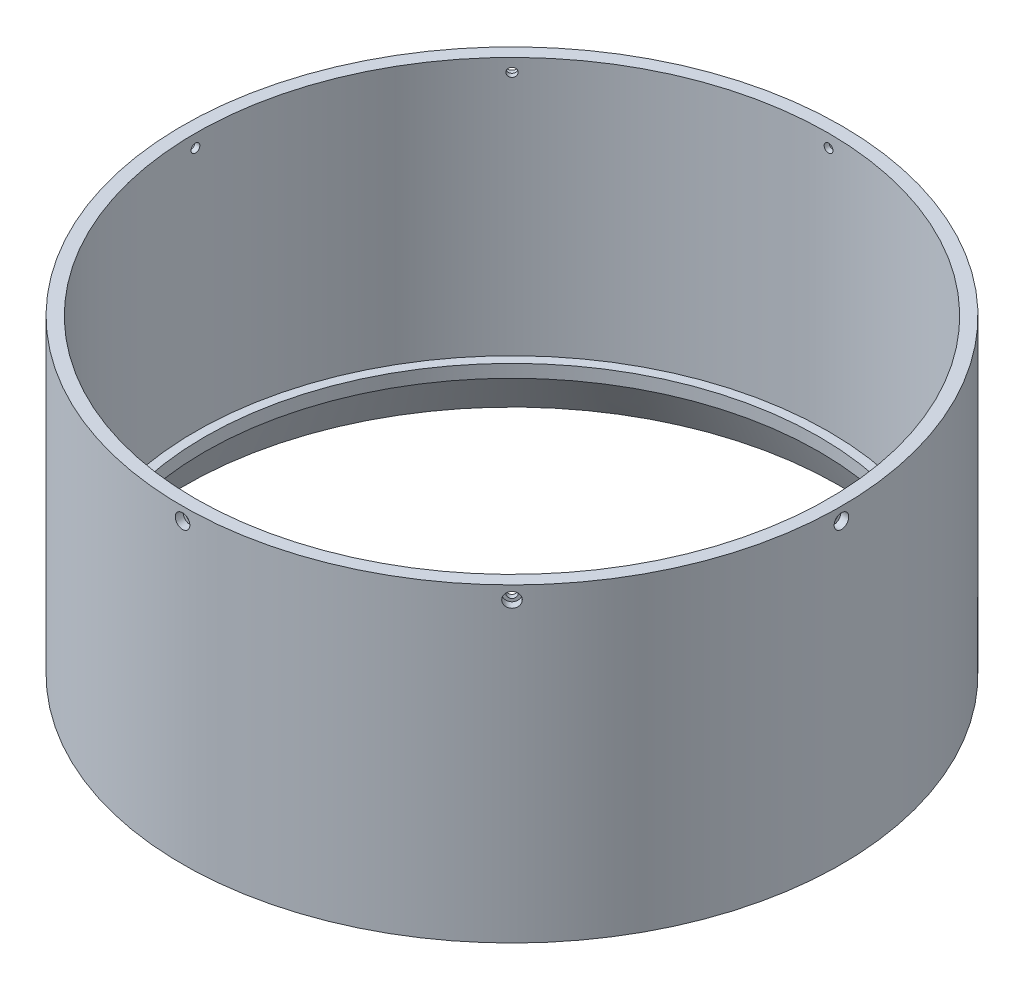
ISO-10303-21;
HEADER;
FILE_DESCRIPTION(('STEP AP214'),'2;1');
FILE_NAME('part.step','',(''),(''),'','','');
FILE_SCHEMA(('AUTOMOTIVE_DESIGN { 1 0 10303 214 1 1 1 1 }'));
ENDSEC;
DATA;
#1=APPLICATION_CONTEXT('core data for automotive mechanical design processes');
#2=APPLICATION_PROTOCOL_DEFINITION('international standard','automotive_design',2000,#1);
#3=PRODUCT_CONTEXT('',#1,'mechanical');
#4=PRODUCT('Part','Part','',(#3));
#5=PRODUCT_RELATED_PRODUCT_CATEGORY('part','',(#4));
#6=PRODUCT_DEFINITION_FORMATION('','',#4);
#7=PRODUCT_DEFINITION_CONTEXT('part definition',#1,'design');
#8=PRODUCT_DEFINITION('design','',#6,#7);
#9=PRODUCT_DEFINITION_SHAPE('','',#8);
#10=(LENGTH_UNIT() NAMED_UNIT(*) SI_UNIT(.MILLI.,.METRE.));
#11=(NAMED_UNIT(*) PLANE_ANGLE_UNIT() SI_UNIT($,.RADIAN.));
#12=(NAMED_UNIT(*) SI_UNIT($,.STERADIAN.) SOLID_ANGLE_UNIT());
#13=UNCERTAINTY_MEASURE_WITH_UNIT(LENGTH_MEASURE(1.E-05),#10,'distance_accuracy_value','');
#14=(GEOMETRIC_REPRESENTATION_CONTEXT(3) GLOBAL_UNCERTAINTY_ASSIGNED_CONTEXT((#13)) GLOBAL_UNIT_ASSIGNED_CONTEXT((#10,
#11,#12)) REPRESENTATION_CONTEXT('',''));
#15=CARTESIAN_POINT('',(0.,0.,0.));
#16=DIRECTION('',(0.,0.,1.));
#17=DIRECTION('',(1.,0.,0.));
#18=AXIS2_PLACEMENT_3D('',#15,#16,#17);
#19=CARTESIAN_POINT('',(0.,0.,0.));
#20=DIRECTION('',(0.,-1.,0.));
#21=DIRECTION('',(0.,0.,-1.));
#22=AXIS2_PLACEMENT_3D('',#19,#20,#21);
#23=CYLINDRICAL_SURFACE('',#22,161.925);
#24=CARTESIAN_POINT('',(-116.996541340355,146.05,-111.944249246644));
#25=CARTESIAN_POINT('',(-116.996535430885,145.849356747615,-111.944255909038));
#26=CARTESIAN_POINT('',(-116.984815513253,145.648568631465,-111.956508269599));
#27=CARTESIAN_POINT('',(-116.938203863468,145.252524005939,-112.005192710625));
#28=CARTESIAN_POINT('',(-116.903284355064,145.057274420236,-112.041653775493));
#29=CARTESIAN_POINT('',(-116.811203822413,144.678101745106,-112.137650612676));
#30=CARTESIAN_POINT('',(-116.754053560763,144.494173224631,-112.197175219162));
#31=CARTESIAN_POINT('',(-116.619048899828,144.142828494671,-112.337493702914));
#32=CARTESIAN_POINT('',(-116.541199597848,143.97540823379,-112.418282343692));
#33=CARTESIAN_POINT('',(-116.366853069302,143.661728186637,-112.598742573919));
#34=CARTESIAN_POINT('',(-116.270351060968,143.515473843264,-112.698419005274));
#35=CARTESIAN_POINT('',(-116.06131163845,143.248322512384,-112.91368396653));
#36=CARTESIAN_POINT('',(-115.94877359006,143.127426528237,-113.029273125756));
#37=CARTESIAN_POINT('',(-115.710718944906,142.914420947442,-113.272962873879));
#38=CARTESIAN_POINT('',(-115.585201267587,142.822313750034,-113.401064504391));
#39=CARTESIAN_POINT('',(-115.324648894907,142.669516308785,-113.666026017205));
#40=CARTESIAN_POINT('',(-115.189614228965,142.608825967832,-113.802885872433));
#41=CARTESIAN_POINT('',(-114.913807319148,142.520594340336,-114.081378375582));
#42=CARTESIAN_POINT('',(-114.773036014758,142.493047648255,-114.223010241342));
#43=CARTESIAN_POINT('',(-114.489696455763,142.471868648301,-114.507009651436));
#44=CARTESIAN_POINT('',(-114.347128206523,142.478236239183,-114.649377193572));
#45=CARTESIAN_POINT('',(-114.064276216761,142.524700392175,-114.930789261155));
#46=CARTESIAN_POINT('',(-113.923992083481,142.564791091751,-115.069834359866));
#47=CARTESIAN_POINT('',(-113.649716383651,142.677554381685,-115.340733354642));
#48=CARTESIAN_POINT('',(-113.51572482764,142.750227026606,-115.472587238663));
#49=CARTESIAN_POINT('',(-113.257914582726,142.926098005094,-115.725464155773));
#50=CARTESIAN_POINT('',(-113.134096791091,143.029299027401,-115.846486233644));
#51=CARTESIAN_POINT('',(-112.900276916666,143.263295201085,-116.074371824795));
#52=CARTESIAN_POINT('',(-112.79027484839,143.39409038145,-116.181235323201));
#53=CARTESIAN_POINT('',(-112.587316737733,143.679595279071,-116.377926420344));
#54=CARTESIAN_POINT('',(-112.494364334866,143.834310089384,-116.467750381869));
#55=CARTESIAN_POINT('',(-112.328304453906,144.163244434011,-116.627916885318));
#56=CARTESIAN_POINT('',(-112.25519697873,144.337463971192,-116.698259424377));
#57=CARTESIAN_POINT('',(-112.131019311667,144.700465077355,-116.817582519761));
#58=CARTESIAN_POINT('',(-112.079949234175,144.889246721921,-116.866562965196));
#59=CARTESIAN_POINT('',(-112.001386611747,145.27601186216,-116.94185738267));
#60=CARTESIAN_POINT('',(-111.973894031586,145.473995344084,-116.968171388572));
#61=CARTESIAN_POINT('',(-111.94332111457,145.873499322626,-116.997431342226));
#62=CARTESIAN_POINT('',(-111.940235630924,146.075019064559,-117.000382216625));
#63=CARTESIAN_POINT('',(-111.958556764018,146.475914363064,-116.982850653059));
#64=CARTESIAN_POINT('',(-111.979963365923,146.675289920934,-116.962368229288));
#65=CARTESIAN_POINT('',(-112.046617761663,147.066217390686,-116.898516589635));
#66=CARTESIAN_POINT('',(-112.091863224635,147.257770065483,-116.855149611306));
#67=CARTESIAN_POINT('',(-112.204829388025,147.627637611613,-116.74668296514));
#68=CARTESIAN_POINT('',(-112.272550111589,147.805952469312,-116.681583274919));
#69=CARTESIAN_POINT('',(-112.428447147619,148.144315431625,-116.531375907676));
#70=CARTESIAN_POINT('',(-112.516626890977,148.304360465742,-116.446264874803));
#71=CARTESIAN_POINT('',(-112.710804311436,148.60160983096,-116.258326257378));
#72=CARTESIAN_POINT('',(-112.816802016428,148.738814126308,-116.155498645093));
#73=CARTESIAN_POINT('',(-113.043494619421,148.986510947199,-115.934890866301));
#74=CARTESIAN_POINT('',(-113.164192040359,149.096998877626,-115.817108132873));
#75=CARTESIAN_POINT('',(-113.416721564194,149.288095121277,-115.569823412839));
#76=CARTESIAN_POINT('',(-113.548553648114,149.368703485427,-115.440321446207));
#77=CARTESIAN_POINT('',(-113.819499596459,149.497744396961,-115.17318827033));
#78=CARTESIAN_POINT('',(-113.958612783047,149.546179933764,-115.035557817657));
#79=CARTESIAN_POINT('',(-114.240119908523,149.609510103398,-114.756001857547));
#80=CARTESIAN_POINT('',(-114.382513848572,149.62440472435,-114.614076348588));
#81=CARTESIAN_POINT('',(-114.666487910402,149.620229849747,-114.329972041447));
#82=CARTESIAN_POINT('',(-114.808068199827,149.601167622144,-114.187793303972));
#83=CARTESIAN_POINT('',(-115.08645206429,149.529635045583,-113.90721333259));
#84=CARTESIAN_POINT('',(-115.223255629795,149.477164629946,-113.768812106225));
#85=CARTESIAN_POINT('',(-115.488272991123,149.340305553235,-113.499780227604));
#86=CARTESIAN_POINT('',(-115.616486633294,149.255916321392,-113.369149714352));
#87=CARTESIAN_POINT('',(-115.860781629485,149.057619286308,-113.119474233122));
#88=CARTESIAN_POINT('',(-115.976863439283,148.943712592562,-113.000428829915));
#89=CARTESIAN_POINT('',(-116.193745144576,148.689598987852,-112.777406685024));
#90=CARTESIAN_POINT('',(-116.294543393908,148.549389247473,-112.673431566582));
#91=CARTESIAN_POINT('',(-116.478141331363,148.246609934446,-112.483624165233));
#92=CARTESIAN_POINT('',(-116.560936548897,148.084034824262,-112.397796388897));
#93=CARTESIAN_POINT('',(-116.706313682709,147.74109235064,-112.246839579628));
#94=CARTESIAN_POINT('',(-116.76888405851,147.560714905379,-112.181722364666));
#95=CARTESIAN_POINT('',(-116.872020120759,147.187498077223,-112.074270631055));
#96=CARTESIAN_POINT('',(-116.912612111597,146.994673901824,-112.031908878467));
#97=CARTESIAN_POINT('',(-116.959930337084,146.675522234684,-111.982502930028));
#98=CARTESIAN_POINT('',(-116.973643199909,146.55126733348,-111.968176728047));
#99=CARTESIAN_POINT('',(-116.991950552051,146.301360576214,-111.949047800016));
#100=CARTESIAN_POINT('',(-116.996545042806,146.175708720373,-111.944245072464));
#101=CARTESIAN_POINT('',(-116.996541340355,146.05,-111.944249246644));
#102=B_SPLINE_CURVE_WITH_KNOTS('',3,(#24,#25,#26,#27,#28,#29,#30,#31,#32,#33,#34,#35,#36,#37,
#38,#39,#40,#41,#42,#43,#44,#45,#46,#47,#48,#49,#50,#51,#52,#53,#54,#55,#56,#57,#58,#59,#60,#61,
#62,#63,#64,#65,#66,#67,#68,#69,#70,#71,#72,#73,#74,#75,#76,#77,#78,#79,#80,#81,#82,#83,#84,#85,
#86,#87,#88,#89,#90,#91,#92,#93,#94,#95,#96,#97,#98,#99,#100,#101),.UNSPECIFIED.,.T.,.F.,(4,2,2,
2,2,2,2,2,2,2,2,2,2,2,2,2,2,2,2,2,2,2,2,2,2,2,2,2,2,2,2,2,2,2,2,2,2,2,4),(0.,0.601470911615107,
1.20366324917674,1.80556440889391,2.40731748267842,3.00922502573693,3.61115638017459,
4.21313788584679,4.81511753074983,5.41699898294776,6.01887863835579,6.62065368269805,
7.2224297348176,7.82425880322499,8.42608850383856,9.02804652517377,9.63000463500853,
10.2319658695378,10.8339262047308,11.4357595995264,12.0375926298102,12.6393668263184,
13.2411416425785,13.8430174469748,14.4448941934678,15.0468743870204,15.6488535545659,
16.2507767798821,16.8527002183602,17.4544948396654,18.0562906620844,18.6580972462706,
19.2598812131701,19.8617299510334,20.4637279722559,21.066068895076,21.6676873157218,
22.0445260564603,22.4213647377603),.UNSPECIFIED.);
#103=CARTESIAN_POINT('',(-116.996541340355,146.05,-111.944249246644));
#104=VERTEX_POINT('',#103);
#105=EDGE_CURVE('E10',#104,#104,#102,.T.);
#106=ORIENTED_EDGE('',*,*,#105,.T.);
#107=EDGE_LOOP('',(#106));
#108=FACE_BOUND('',#107,.T.);
#109=CARTESIAN_POINT('',(-161.885585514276,146.05,3.57250999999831));
#110=CARTESIAN_POINT('',(-161.885586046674,145.849356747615,3.57250111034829));
#111=CARTESIAN_POINT('',(-161.88596254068,145.648568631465,3.5555501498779));
#112=CARTESIAN_POINT('',(-161.887428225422,145.252524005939,3.48816563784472));
#113=CARTESIAN_POINT('',(-161.888518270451,145.057274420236,3.43769195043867));
#114=CARTESIAN_POINT('',(-161.891287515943,144.678101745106,3.30470116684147));
#115=CARTESIAN_POINT('',(-161.892966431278,144.494173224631,3.22219957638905));
#116=CARTESIAN_POINT('',(-161.896723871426,144.142828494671,3.0275167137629));
#117=CARTESIAN_POINT('',(-161.898802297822,143.97540823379,2.91534274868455));
#118=CARTESIAN_POINT('',(-161.903125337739,143.661728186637,2.66445648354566));
#119=CARTESIAN_POINT('',(-161.905369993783,143.515473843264,2.52573737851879));
#120=CARTESIAN_POINT('',(-161.909772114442,143.248322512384,2.22570887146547));
#121=CARTESIAN_POINT('',(-161.911929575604,143.127426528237,2.06439857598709));
#122=CARTESIAN_POINT('',(-161.915914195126,142.914420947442,1.72375384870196));
#123=CARTESIAN_POINT('',(-161.917741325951,142.822313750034,1.54441791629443));
#124=CARTESIAN_POINT('',(-161.920859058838,142.669516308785,1.17282348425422));
#125=CARTESIAN_POINT('',(-161.92214966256,142.608825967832,0.980565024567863));
#126=CARTESIAN_POINT('',(-161.924048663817,142.520594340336,0.588616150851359));
#127=CARTESIAN_POINT('',(-161.924657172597,142.493047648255,0.388926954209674));
#128=CARTESIAN_POINT('',(-161.925123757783,142.471868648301,-0.0122422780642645));
#129=CARTESIAN_POINT('',(-161.924981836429,142.478236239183,-0.213722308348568));
#130=CARTESIAN_POINT('',(-161.923963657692,142.524700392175,-0.612717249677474));
#131=CARTESIAN_POINT('',(-161.923087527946,142.564791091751,-0.810232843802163));
#132=CARTESIAN_POINT('',(-161.920699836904,142.677554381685,-1.195729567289));
#133=CARTESIAN_POINT('',(-161.919188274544,142.750227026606,-1.38371068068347));
#134=CARTESIAN_POINT('',(-161.915699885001,142.926098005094,-1.74482103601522));
#135=CARTESIAN_POINT('',(-161.91372301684,143.029299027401,-1.91794896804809));
#136=CARTESIAN_POINT('',(-161.909526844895,143.263295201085,-2.24442403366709));
#137=CARTESIAN_POINT('',(-161.907307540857,143.39409038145,-2.39777114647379));
#138=CARTESIAN_POINT('',(-161.902876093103,143.679595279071,-2.68036581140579));
#139=CARTESIAN_POINT('',(-161.900663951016,143.834310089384,-2.80960821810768));
#140=CARTESIAN_POINT('',(-161.896496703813,144.163244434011,-3.0402851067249));
#141=CARTESIAN_POINT('',(-161.894541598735,144.337463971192,-3.14171958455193));
#142=CARTESIAN_POINT('',(-161.891108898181,144.700465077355,-3.31390062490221));
#143=CARTESIAN_POINT('',(-161.889631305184,144.889246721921,-3.38464702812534));
#144=CARTESIAN_POINT('',(-161.887320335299,145.27601186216,-3.49344038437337));
#145=CARTESIAN_POINT('',(-161.886486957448,145.473995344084,-3.53148738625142));
#146=CARTESIAN_POINT('',(-161.885558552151,145.873499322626,-3.57379561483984));
#147=CARTESIAN_POINT('',(-161.88546336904,146.075019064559,-3.57806396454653));
#148=CARTESIAN_POINT('',(-161.886021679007,146.475914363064,-3.55271227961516));
#149=CARTESIAN_POINT('',(-161.886675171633,146.675289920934,-3.52309226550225));
#150=CARTESIAN_POINT('',(-161.888657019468,147.066217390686,-3.43081056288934));
#151=CARTESIAN_POINT('',(-161.889985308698,147.257770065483,-3.36815210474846));
#152=CARTESIAN_POINT('',(-161.893166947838,147.627637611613,-3.21157546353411));
#153=CARTESIAN_POINT('',(-161.895020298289,147.805952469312,-3.11765724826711));
#154=CARTESIAN_POINT('',(-161.899043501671,148.144315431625,-2.90120874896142));
#155=CARTESIAN_POINT('',(-161.901213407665,148.304360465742,-2.77867366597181));
#156=CARTESIAN_POINT('',(-161.905624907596,148.60160983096,-2.50847682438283));
#157=CARTESIAN_POINT('',(-161.907866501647,148.738814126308,-2.36081502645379));
#158=CARTESIAN_POINT('',(-161.912169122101,148.986510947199,-2.04452589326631));
#159=CARTESIAN_POINT('',(-161.914230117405,149.096998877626,-1.8758949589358));
#160=CARTESIAN_POINT('',(-161.917938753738,149.288095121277,-1.52247291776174));
#161=CARTESIAN_POINT('',(-161.919586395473,149.368703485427,-1.33768183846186));
#162=CARTESIAN_POINT('',(-161.922282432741,149.497744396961,-0.957202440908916));
#163=CARTESIAN_POINT('',(-161.923330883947,149.546179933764,-0.761515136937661));
#164=CARTESIAN_POINT('',(-161.924710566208,149.609510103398,-0.364783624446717));
#165=CARTESIAN_POINT('',(-161.925041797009,149.62440472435,-0.163739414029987));
#166=CARTESIAN_POINT('',(-161.924949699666,149.620229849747,0.237952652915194));
#167=CARTESIAN_POINT('',(-161.924526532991,149.601167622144,0.438600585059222));
#168=CARTESIAN_POINT('',(-161.922973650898,149.529635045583,0.83384770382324));
#169=CARTESIAN_POINT('',(-161.921843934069,149.477164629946,1.02844687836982));
#170=CARTESIAN_POINT('',(-161.919005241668,149.340305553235,1.40607671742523));
#171=CARTESIAN_POINT('',(-161.917296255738,149.255916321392,1.589107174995));
#172=CARTESIAN_POINT('',(-161.91349167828,149.057619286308,1.93839704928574));
#173=CARTESIAN_POINT('',(-161.911396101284,148.943712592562,2.1046570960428));
#174=CARTESIAN_POINT('',(-161.907054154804,148.689598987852,2.41571609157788));
#175=CARTESIAN_POINT('',(-161.904807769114,148.549389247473,2.5605127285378));
#176=CARTESIAN_POINT('',(-161.900417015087,148.246609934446,2.82455017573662));
#177=CARTESIAN_POINT('',(-161.898272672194,148.084034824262,2.94378463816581));
#178=CARTESIAN_POINT('',(-161.894327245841,147.74109235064,3.1533243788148));
#179=CARTESIAN_POINT('',(-161.8925263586,147.560714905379,3.24361314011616));
#180=CARTESIAN_POINT('',(-161.889474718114,147.187498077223,3.39252119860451));
#181=CARTESIAN_POINT('',(-161.88822330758,146.994673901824,3.45117835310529));
#182=CARTESIAN_POINT('',(-161.886747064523,146.675522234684,3.51957267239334));
#183=CARTESIAN_POINT('',(-161.886313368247,146.55126733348,3.53939928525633));
#184=CARTESIAN_POINT('',(-161.885732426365,146.301360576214,3.56587073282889));
#185=CARTESIAN_POINT('',(-161.885585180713,146.175708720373,3.57251556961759));
#186=CARTESIAN_POINT('',(-161.885585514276,146.05,3.57250999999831));
#187=B_SPLINE_CURVE_WITH_KNOTS('',3,(#109,#110,#111,#112,#113,#114,#115,#116,#117,#118,#119,
#120,#121,#122,#123,#124,#125,#126,#127,#128,#129,#130,#131,#132,#133,#134,#135,#136,#137,#138,
#139,#140,#141,#142,#143,#144,#145,#146,#147,#148,#149,#150,#151,#152,#153,#154,#155,#156,#157,
#158,#159,#160,#161,#162,#163,#164,#165,#166,#167,#168,#169,#170,#171,#172,#173,#174,#175,#176,
#177,#178,#179,#180,#181,#182,#183,#184,#185,#186),.UNSPECIFIED.,.T.,.F.,(4,2,2,2,2,2,2,2,2,2,2,
2,2,2,2,2,2,2,2,2,2,2,2,2,2,2,2,2,2,2,2,2,2,2,2,2,2,2,4),(0.,0.601470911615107,1.20366324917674,
1.80556440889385,2.40731748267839,3.00922502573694,3.61115638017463,4.21313788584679,
4.81511753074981,5.41699898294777,6.0188786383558,6.62065368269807,7.2224297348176,
7.82425880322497,8.42608850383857,9.02804652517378,9.63000463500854,10.2319658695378,
10.8339262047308,11.4357595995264,12.0375926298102,12.6393668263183,13.2411416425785,
13.8430174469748,14.4448941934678,15.0468743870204,15.6488535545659,16.2507767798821,
16.8527002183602,17.4544948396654,18.0562906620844,18.6580972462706,19.2598812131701,
19.8617299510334,20.4637279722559,21.0660688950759,21.6676873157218,22.0445260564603,
22.4213647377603),.UNSPECIFIED.);
#188=CARTESIAN_POINT('',(-161.885585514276,146.05,3.57250999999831));
#189=VERTEX_POINT('',#188);
#190=EDGE_CURVE('E41',#189,#189,#187,.T.);
#191=ORIENTED_EDGE('',*,*,#190,.T.);
#192=EDGE_LOOP('',(#191));
#193=FACE_BOUND('',#192,.T.);
#194=CARTESIAN_POINT('',(-111.944249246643,146.05,116.996541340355));
#195=CARTESIAN_POINT('',(-111.944255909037,145.849356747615,116.996535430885));
#196=CARTESIAN_POINT('',(-111.956508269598,145.648568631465,116.984815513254));
#197=CARTESIAN_POINT('',(-112.005192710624,145.252524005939,116.938203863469));
#198=CARTESIAN_POINT('',(-112.041653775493,145.057274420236,116.903284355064));
#199=CARTESIAN_POINT('',(-112.137650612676,144.678101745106,116.811203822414));
#200=CARTESIAN_POINT('',(-112.197175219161,144.494173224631,116.754053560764));
#201=CARTESIAN_POINT('',(-112.337493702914,144.142828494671,116.619048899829));
#202=CARTESIAN_POINT('',(-112.418282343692,143.97540823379,116.541199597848));
#203=CARTESIAN_POINT('',(-112.598742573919,143.661728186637,116.366853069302));
#204=CARTESIAN_POINT('',(-112.698419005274,143.515473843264,116.270351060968));
#205=CARTESIAN_POINT('',(-112.91368396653,143.248322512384,116.061311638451));
#206=CARTESIAN_POINT('',(-113.029273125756,143.127426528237,115.948773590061));
#207=CARTESIAN_POINT('',(-113.272962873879,142.914420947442,115.710718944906));
#208=CARTESIAN_POINT('',(-113.401064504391,142.822313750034,115.585201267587));
#209=CARTESIAN_POINT('',(-113.666026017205,142.669516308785,115.324648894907));
#210=CARTESIAN_POINT('',(-113.802885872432,142.608825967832,115.189614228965));
#211=CARTESIAN_POINT('',(-114.081378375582,142.520594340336,114.913807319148));
#212=CARTESIAN_POINT('',(-114.223010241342,142.493047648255,114.773036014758));
#213=CARTESIAN_POINT('',(-114.507009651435,142.471868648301,114.489696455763));
#214=CARTESIAN_POINT('',(-114.649377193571,142.478236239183,114.347128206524));
#215=CARTESIAN_POINT('',(-114.930789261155,142.524700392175,114.064276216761));
#216=CARTESIAN_POINT('',(-115.069834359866,142.564791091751,113.923992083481));
#217=CARTESIAN_POINT('',(-115.340733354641,142.677554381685,113.649716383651));
#218=CARTESIAN_POINT('',(-115.472587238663,142.750227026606,113.51572482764));
#219=CARTESIAN_POINT('',(-115.725464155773,142.926098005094,113.257914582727));
#220=CARTESIAN_POINT('',(-115.846486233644,143.029299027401,113.134096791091));
#221=CARTESIAN_POINT('',(-116.074371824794,143.263295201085,112.900276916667));
#222=CARTESIAN_POINT('',(-116.1812353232,143.39409038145,112.790274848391));
#223=CARTESIAN_POINT('',(-116.377926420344,143.679595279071,112.587316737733));
#224=CARTESIAN_POINT('',(-116.467750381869,143.834310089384,112.494364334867));
#225=CARTESIAN_POINT('',(-116.627916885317,144.163244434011,112.328304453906));
#226=CARTESIAN_POINT('',(-116.698259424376,144.337463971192,112.25519697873));
#227=CARTESIAN_POINT('',(-116.81758251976,144.700465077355,112.131019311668));
#228=CARTESIAN_POINT('',(-116.866562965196,144.889246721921,112.079949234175));
#229=CARTESIAN_POINT('',(-116.94185738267,145.27601186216,112.001386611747));
#230=CARTESIAN_POINT('',(-116.968171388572,145.473995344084,111.973894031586));
#231=CARTESIAN_POINT('',(-116.997431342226,145.873499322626,111.94332111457));
#232=CARTESIAN_POINT('',(-117.000382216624,146.075019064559,111.940235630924));
#233=CARTESIAN_POINT('',(-116.982850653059,146.475914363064,111.958556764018));
#234=CARTESIAN_POINT('',(-116.962368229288,146.675289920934,111.979963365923));
#235=CARTESIAN_POINT('',(-116.898516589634,147.066217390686,112.046617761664));
#236=CARTESIAN_POINT('',(-116.855149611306,147.257770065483,112.091863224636));
#237=CARTESIAN_POINT('',(-116.746682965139,147.627637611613,112.204829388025));
#238=CARTESIAN_POINT('',(-116.681583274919,147.805952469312,112.272550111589));
#239=CARTESIAN_POINT('',(-116.531375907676,148.144315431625,112.428447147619));
#240=CARTESIAN_POINT('',(-116.446264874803,148.304360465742,112.516626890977));
#241=CARTESIAN_POINT('',(-116.258326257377,148.60160983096,112.710804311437));
#242=CARTESIAN_POINT('',(-116.155498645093,148.738814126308,112.816802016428));
#243=CARTESIAN_POINT('',(-115.934890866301,148.986510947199,113.043494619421));
#244=CARTESIAN_POINT('',(-115.817108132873,149.096998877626,113.164192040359));
#245=CARTESIAN_POINT('',(-115.569823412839,149.288095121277,113.416721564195));
#246=CARTESIAN_POINT('',(-115.440321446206,149.368703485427,113.548553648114));
#247=CARTESIAN_POINT('',(-115.173188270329,149.497744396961,113.81949959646));
#248=CARTESIAN_POINT('',(-115.035557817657,149.546179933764,113.958612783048));
#249=CARTESIAN_POINT('',(-114.756001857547,149.609510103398,114.240119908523));
#250=CARTESIAN_POINT('',(-114.614076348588,149.62440472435,114.382513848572));
#251=CARTESIAN_POINT('',(-114.329972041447,149.620229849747,114.666487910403));
#252=CARTESIAN_POINT('',(-114.187793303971,149.601167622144,114.808068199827));
#253=CARTESIAN_POINT('',(-113.90721333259,149.529635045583,115.086452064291));
#254=CARTESIAN_POINT('',(-113.768812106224,149.477164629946,115.223255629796));
#255=CARTESIAN_POINT('',(-113.499780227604,149.340305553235,115.488272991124));
#256=CARTESIAN_POINT('',(-113.369149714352,149.255916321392,115.616486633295));
#257=CARTESIAN_POINT('',(-113.119474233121,149.057619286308,115.860781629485));
#258=CARTESIAN_POINT('',(-113.000428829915,148.943712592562,115.976863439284));
#259=CARTESIAN_POINT('',(-112.777406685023,148.689598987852,116.193745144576));
#260=CARTESIAN_POINT('',(-112.673431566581,148.549389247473,116.294543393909));
#261=CARTESIAN_POINT('',(-112.483624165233,148.246609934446,116.478141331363));
#262=CARTESIAN_POINT('',(-112.397796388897,148.084034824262,116.560936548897));
#263=CARTESIAN_POINT('',(-112.246839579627,147.74109235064,116.706313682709));
#264=CARTESIAN_POINT('',(-112.181722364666,147.560714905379,116.76888405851));
#265=CARTESIAN_POINT('',(-112.074270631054,147.187498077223,116.872020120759));
#266=CARTESIAN_POINT('',(-112.031908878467,146.994673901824,116.912612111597));
#267=CARTESIAN_POINT('',(-111.982502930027,146.675522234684,116.959930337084));
#268=CARTESIAN_POINT('',(-111.968176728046,146.55126733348,116.97364319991));
#269=CARTESIAN_POINT('',(-111.949047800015,146.301360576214,116.991950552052));
#270=CARTESIAN_POINT('',(-111.944245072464,146.175708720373,116.996545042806));
#271=CARTESIAN_POINT('',(-111.944249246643,146.05,116.996541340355));
#272=B_SPLINE_CURVE_WITH_KNOTS('',3,(#194,#195,#196,#197,#198,#199,#200,#201,#202,#203,#204,
#205,#206,#207,#208,#209,#210,#211,#212,#213,#214,#215,#216,#217,#218,#219,#220,#221,#222,#223,
#224,#225,#226,#227,#228,#229,#230,#231,#232,#233,#234,#235,#236,#237,#238,#239,#240,#241,#242,
#243,#244,#245,#246,#247,#248,#249,#250,#251,#252,#253,#254,#255,#256,#257,#258,#259,#260,#261,
#262,#263,#264,#265,#266,#267,#268,#269,#270,#271),.UNSPECIFIED.,.T.,.F.,(4,2,2,2,2,2,2,2,2,2,2,
2,2,2,2,2,2,2,2,2,2,2,2,2,2,2,2,2,2,2,2,2,2,2,2,2,2,2,4),(0.,0.601470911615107,1.20366324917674,
1.80556440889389,2.40731748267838,3.00922502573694,3.61115638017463,4.21313788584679,
4.81511753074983,5.41699898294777,6.01887863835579,6.62065368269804,7.2224297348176,
7.82425880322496,8.42608850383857,9.02804652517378,9.63000463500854,10.2319658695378,
10.8339262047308,11.4357595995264,12.0375926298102,12.6393668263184,13.2411416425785,
13.8430174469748,14.4448941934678,15.0468743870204,15.6488535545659,16.2507767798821,
16.8527002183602,17.4544948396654,18.0562906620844,18.6580972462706,19.2598812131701,
19.8617299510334,20.4637279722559,21.0660688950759,21.6676873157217,22.0445260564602,
22.4213647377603),.UNSPECIFIED.);
#273=CARTESIAN_POINT('',(-111.944249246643,146.05,116.996541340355));
#274=VERTEX_POINT('',#273);
#275=EDGE_CURVE('E45',#274,#274,#272,.T.);
#276=ORIENTED_EDGE('',*,*,#275,.T.);
#277=EDGE_LOOP('',(#276));
#278=FACE_BOUND('',#277,.T.);
#279=CARTESIAN_POINT('',(3.57251,146.05,161.885585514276));
#280=CARTESIAN_POINT('',(3.57250111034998,145.849356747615,161.885586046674));
#281=CARTESIAN_POINT('',(3.55555014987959,145.648568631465,161.88596254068));
#282=CARTESIAN_POINT('',(3.4881656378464,145.252524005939,161.887428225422));
#283=CARTESIAN_POINT('',(3.43769195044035,145.057274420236,161.888518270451));
#284=CARTESIAN_POINT('',(3.30470116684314,144.678101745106,161.891287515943));
#285=CARTESIAN_POINT('',(3.22219957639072,144.494173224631,161.892966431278));
#286=CARTESIAN_POINT('',(3.02751671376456,144.142828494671,161.896723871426));
#287=CARTESIAN_POINT('',(2.9153427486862,143.97540823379,161.898802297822));
#288=CARTESIAN_POINT('',(2.6644564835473,143.661728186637,161.903125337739));
#289=CARTESIAN_POINT('',(2.52573737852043,143.515473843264,161.905369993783));
#290=CARTESIAN_POINT('',(2.22570887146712,143.248322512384,161.909772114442));
#291=CARTESIAN_POINT('',(2.06439857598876,143.127426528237,161.911929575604));
#292=CARTESIAN_POINT('',(1.72375384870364,142.914420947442,161.915914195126));
#293=CARTESIAN_POINT('',(1.5444179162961,142.822313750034,161.917741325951));
#294=CARTESIAN_POINT('',(1.17282348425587,142.669516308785,161.920859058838));
#295=CARTESIAN_POINT('',(0.980565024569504,142.608825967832,161.92214966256));
#296=CARTESIAN_POINT('',(0.588616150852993,142.520594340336,161.924048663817));
#297=CARTESIAN_POINT('',(0.388926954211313,142.493047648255,161.924657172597));
#298=CARTESIAN_POINT('',(-0.0122422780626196,142.471868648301,161.925123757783));
#299=CARTESIAN_POINT('',(-0.213722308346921,142.478236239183,161.924981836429));
#300=CARTESIAN_POINT('',(-0.612717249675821,142.524700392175,161.923963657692));
#301=CARTESIAN_POINT('',(-0.810232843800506,142.564791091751,161.923087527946));
#302=CARTESIAN_POINT('',(-1.19572956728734,142.677554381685,161.920699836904));
#303=CARTESIAN_POINT('',(-1.38371068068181,142.750227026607,161.919188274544));
#304=CARTESIAN_POINT('',(-1.74482103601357,142.926098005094,161.915699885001));
#305=CARTESIAN_POINT('',(-1.91794896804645,143.029299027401,161.91372301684));
#306=CARTESIAN_POINT('',(-2.24442403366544,143.263295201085,161.909526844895));
#307=CARTESIAN_POINT('',(-2.39777114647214,143.39409038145,161.907307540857));
#308=CARTESIAN_POINT('',(-2.68036581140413,143.679595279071,161.902876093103));
#309=CARTESIAN_POINT('',(-2.80960821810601,143.834310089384,161.900663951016));
#310=CARTESIAN_POINT('',(-3.04028510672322,144.163244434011,161.896496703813));
#311=CARTESIAN_POINT('',(-3.14171958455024,144.337463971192,161.894541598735));
#312=CARTESIAN_POINT('',(-3.31390062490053,144.700465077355,161.891108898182));
#313=CARTESIAN_POINT('',(-3.38464702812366,144.889246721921,161.889631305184));
#314=CARTESIAN_POINT('',(-3.49344038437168,145.27601186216,161.887320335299));
#315=CARTESIAN_POINT('',(-3.53148738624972,145.473995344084,161.886486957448));
#316=CARTESIAN_POINT('',(-3.57379561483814,145.873499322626,161.885558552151));
#317=CARTESIAN_POINT('',(-3.57806396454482,146.075019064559,161.88546336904));
#318=CARTESIAN_POINT('',(-3.55271227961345,146.475914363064,161.886021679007));
#319=CARTESIAN_POINT('',(-3.52309226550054,146.675289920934,161.886675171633));
#320=CARTESIAN_POINT('',(-3.43081056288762,147.066217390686,161.888657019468));
#321=CARTESIAN_POINT('',(-3.36815210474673,147.257770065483,161.889985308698));
#322=CARTESIAN_POINT('',(-3.21157546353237,147.627637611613,161.893166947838));
#323=CARTESIAN_POINT('',(-3.11765724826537,147.805952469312,161.895020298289));
#324=CARTESIAN_POINT('',(-2.90120874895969,148.144315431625,161.899043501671));
#325=CARTESIAN_POINT('',(-2.77867366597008,148.304360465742,161.901213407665));
#326=CARTESIAN_POINT('',(-2.50847682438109,148.60160983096,161.905624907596));
#327=CARTESIAN_POINT('',(-2.36081502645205,148.738814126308,161.907866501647));
#328=CARTESIAN_POINT('',(-2.04452589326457,148.986510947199,161.912169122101));
#329=CARTESIAN_POINT('',(-1.87589495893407,149.096998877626,161.914230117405));
#330=CARTESIAN_POINT('',(-1.52247291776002,149.288095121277,161.917938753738));
#331=CARTESIAN_POINT('',(-1.33768183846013,149.368703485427,161.919586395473));
#332=CARTESIAN_POINT('',(-0.957202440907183,149.497744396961,161.922282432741));
#333=CARTESIAN_POINT('',(-0.761515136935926,149.546179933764,161.923330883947));
#334=CARTESIAN_POINT('',(-0.364783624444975,149.609510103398,161.924710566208));
#335=CARTESIAN_POINT('',(-0.163739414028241,149.62440472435,161.925041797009));
#336=CARTESIAN_POINT('',(0.237952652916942,149.620229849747,161.924949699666));
#337=CARTESIAN_POINT('',(0.438600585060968,149.601167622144,161.924526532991));
#338=CARTESIAN_POINT('',(0.833847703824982,149.529635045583,161.922973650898));
#339=CARTESIAN_POINT('',(1.02844687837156,149.477164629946,161.921843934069));
#340=CARTESIAN_POINT('',(1.40607671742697,149.340305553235,161.919005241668));
#341=CARTESIAN_POINT('',(1.58910717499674,149.255916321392,161.917296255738));
#342=CARTESIAN_POINT('',(1.93839704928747,149.057619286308,161.91349167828));
#343=CARTESIAN_POINT('',(2.10465709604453,148.943712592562,161.911396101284));
#344=CARTESIAN_POINT('',(2.41571609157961,148.689598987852,161.907054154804));
#345=CARTESIAN_POINT('',(2.56051272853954,148.549389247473,161.904807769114));
#346=CARTESIAN_POINT('',(2.82455017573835,148.246609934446,161.900417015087));
#347=CARTESIAN_POINT('',(2.94378463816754,148.084034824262,161.898272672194));
#348=CARTESIAN_POINT('',(3.15332437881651,147.74109235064,161.894327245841));
#349=CARTESIAN_POINT('',(3.24361314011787,147.560714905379,161.8925263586));
#350=CARTESIAN_POINT('',(3.39252119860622,147.187498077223,161.889474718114));
#351=CARTESIAN_POINT('',(3.45117835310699,146.994673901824,161.88822330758));
#352=CARTESIAN_POINT('',(3.51957267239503,146.675522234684,161.886747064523));
#353=CARTESIAN_POINT('',(3.53939928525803,146.55126733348,161.886313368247));
#354=CARTESIAN_POINT('',(3.56587073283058,146.301360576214,161.885732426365));
#355=CARTESIAN_POINT('',(3.57251556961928,146.175708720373,161.885585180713));
#356=CARTESIAN_POINT('',(3.57251,146.05,161.885585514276));
#357=B_SPLINE_CURVE_WITH_KNOTS('',3,(#279,#280,#281,#282,#283,#284,#285,#286,#287,#288,#289,
#290,#291,#292,#293,#294,#295,#296,#297,#298,#299,#300,#301,#302,#303,#304,#305,#306,#307,#308,
#309,#310,#311,#312,#313,#314,#315,#316,#317,#318,#319,#320,#321,#322,#323,#324,#325,#326,#327,
#328,#329,#330,#331,#332,#333,#334,#335,#336,#337,#338,#339,#340,#341,#342,#343,#344,#345,#346,
#347,#348,#349,#350,#351,#352,#353,#354,#355,#356),.UNSPECIFIED.,.T.,.F.,(4,2,2,2,2,2,2,2,2,2,2,
2,2,2,2,2,2,2,2,2,2,2,2,2,2,2,2,2,2,2,2,2,2,2,2,2,2,2,4),(0.,0.601470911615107,1.20366324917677,
1.80556440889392,2.40731748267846,3.00922502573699,3.61115638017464,4.21313788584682,
4.81511753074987,5.41699898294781,6.01887863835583,6.6206536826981,7.22242973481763,
7.82425880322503,8.42608850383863,9.02804652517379,9.63000463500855,10.2319658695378,
10.8339262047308,11.4357595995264,12.0375926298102,12.6393668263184,13.2411416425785,
13.8430174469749,14.4448941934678,15.0468743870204,15.6488535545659,16.2507767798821,
16.8527002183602,17.4544948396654,18.0562906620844,18.6580972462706,19.2598812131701,
19.8617299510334,20.4637279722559,21.0660688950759,21.6676873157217,22.0445260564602,
22.4213647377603),.UNSPECIFIED.);
#358=CARTESIAN_POINT('',(3.57251,146.05,161.885585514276));
#359=VERTEX_POINT('',#358);
#360=EDGE_CURVE('E49',#359,#359,#357,.T.);
#361=ORIENTED_EDGE('',*,*,#360,.T.);
#362=EDGE_LOOP('',(#361));
#363=FACE_BOUND('',#362,.T.);
#364=CARTESIAN_POINT('',(116.996541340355,146.05,111.944249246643));
#365=CARTESIAN_POINT('',(116.996535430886,145.849356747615,111.944255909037));
#366=CARTESIAN_POINT('',(116.984815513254,145.648568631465,111.956508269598));
#367=CARTESIAN_POINT('',(116.938203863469,145.252524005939,112.005192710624));
#368=CARTESIAN_POINT('',(116.903284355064,145.057274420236,112.041653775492));
#369=CARTESIAN_POINT('',(116.811203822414,144.678101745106,112.137650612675));
#370=CARTESIAN_POINT('',(116.754053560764,144.494173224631,112.197175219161));
#371=CARTESIAN_POINT('',(116.619048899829,144.142828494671,112.337493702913));
#372=CARTESIAN_POINT('',(116.541199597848,143.97540823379,112.418282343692));
#373=CARTESIAN_POINT('',(116.366853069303,143.661728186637,112.598742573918));
#374=CARTESIAN_POINT('',(116.270351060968,143.515473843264,112.698419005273));
#375=CARTESIAN_POINT('',(116.061311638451,143.248322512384,112.913683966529));
#376=CARTESIAN_POINT('',(115.948773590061,143.127426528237,113.029273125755));
#377=CARTESIAN_POINT('',(115.710718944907,142.914420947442,113.272962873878));
#378=CARTESIAN_POINT('',(115.585201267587,142.822313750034,113.401064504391));
#379=CARTESIAN_POINT('',(115.324648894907,142.669516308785,113.666026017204));
#380=CARTESIAN_POINT('',(115.189614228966,142.608825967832,113.802885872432));
#381=CARTESIAN_POINT('',(114.913807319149,142.520594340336,114.081378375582));
#382=CARTESIAN_POINT('',(114.773036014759,142.493047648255,114.223010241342));
#383=CARTESIAN_POINT('',(114.489696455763,142.471868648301,114.507009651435));
#384=CARTESIAN_POINT('',(114.347128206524,142.478236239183,114.649377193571));
#385=CARTESIAN_POINT('',(114.064276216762,142.524700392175,114.930789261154));
#386=CARTESIAN_POINT('',(113.923992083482,142.564791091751,115.069834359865));
#387=CARTESIAN_POINT('',(113.649716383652,142.677554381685,115.340733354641));
#388=CARTESIAN_POINT('',(113.51572482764,142.750227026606,115.472587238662));
#389=CARTESIAN_POINT('',(113.257914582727,142.926098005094,115.725464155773));
#390=CARTESIAN_POINT('',(113.134096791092,143.029299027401,115.846486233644));
#391=CARTESIAN_POINT('',(112.900276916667,143.263295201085,116.074371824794));
#392=CARTESIAN_POINT('',(112.790274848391,143.39409038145,116.1812353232));
#393=CARTESIAN_POINT('',(112.587316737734,143.679595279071,116.377926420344));
#394=CARTESIAN_POINT('',(112.494364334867,143.834310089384,116.467750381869));
#395=CARTESIAN_POINT('',(112.328304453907,144.163244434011,116.627916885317));
#396=CARTESIAN_POINT('',(112.255196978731,144.337463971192,116.698259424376));
#397=CARTESIAN_POINT('',(112.131019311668,144.700465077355,116.81758251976));
#398=CARTESIAN_POINT('',(112.079949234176,144.889246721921,116.866562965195));
#399=CARTESIAN_POINT('',(112.001386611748,145.27601186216,116.941857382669));
#400=CARTESIAN_POINT('',(111.973894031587,145.473995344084,116.968171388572));
#401=CARTESIAN_POINT('',(111.943321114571,145.873499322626,116.997431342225));
#402=CARTESIAN_POINT('',(111.940235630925,146.075019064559,117.000382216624));
#403=CARTESIAN_POINT('',(111.958556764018,146.475914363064,116.982850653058));
#404=CARTESIAN_POINT('',(111.979963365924,146.675289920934,116.962368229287));
#405=CARTESIAN_POINT('',(112.046617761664,147.066217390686,116.898516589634));
#406=CARTESIAN_POINT('',(112.091863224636,147.257770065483,116.855149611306));
#407=CARTESIAN_POINT('',(112.204829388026,147.627637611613,116.746682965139));
#408=CARTESIAN_POINT('',(112.27255011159,147.805952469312,116.681583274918));
#409=CARTESIAN_POINT('',(112.42844714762,148.144315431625,116.531375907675));
#410=CARTESIAN_POINT('',(112.516626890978,148.304360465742,116.446264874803));
#411=CARTESIAN_POINT('',(112.710804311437,148.60160983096,116.258326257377));
#412=CARTESIAN_POINT('',(112.816802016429,148.738814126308,116.155498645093));
#413=CARTESIAN_POINT('',(113.043494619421,148.986510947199,115.934890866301));
#414=CARTESIAN_POINT('',(113.164192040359,149.096998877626,115.817108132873));
#415=CARTESIAN_POINT('',(113.416721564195,149.288095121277,115.569823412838));
#416=CARTESIAN_POINT('',(113.548553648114,149.368703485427,115.440321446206));
#417=CARTESIAN_POINT('',(113.81949959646,149.497744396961,115.173188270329));
#418=CARTESIAN_POINT('',(113.958612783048,149.546179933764,115.035557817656));
#419=CARTESIAN_POINT('',(114.240119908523,149.609510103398,114.756001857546));
#420=CARTESIAN_POINT('',(114.382513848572,149.62440472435,114.614076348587));
#421=CARTESIAN_POINT('',(114.666487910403,149.620229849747,114.329972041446));
#422=CARTESIAN_POINT('',(114.808068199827,149.601167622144,114.187793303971));
#423=CARTESIAN_POINT('',(115.086452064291,149.529635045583,113.90721333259));
#424=CARTESIAN_POINT('',(115.223255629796,149.477164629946,113.768812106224));
#425=CARTESIAN_POINT('',(115.488272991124,149.340305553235,113.499780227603));
#426=CARTESIAN_POINT('',(115.616486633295,149.255916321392,113.369149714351));
#427=CARTESIAN_POINT('',(115.860781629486,149.057619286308,113.119474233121));
#428=CARTESIAN_POINT('',(115.976863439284,148.943712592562,113.000428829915));
#429=CARTESIAN_POINT('',(116.193745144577,148.689598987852,112.777406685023));
#430=CARTESIAN_POINT('',(116.294543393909,148.549389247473,112.673431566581));
#431=CARTESIAN_POINT('',(116.478141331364,148.246609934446,112.483624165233));
#432=CARTESIAN_POINT('',(116.560936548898,148.084034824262,112.397796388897));
#433=CARTESIAN_POINT('',(116.70631368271,147.74109235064,112.246839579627));
#434=CARTESIAN_POINT('',(116.768884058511,147.560714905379,112.181722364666));
#435=CARTESIAN_POINT('',(116.87202012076,147.187498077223,112.074270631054));
#436=CARTESIAN_POINT('',(116.912612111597,146.994673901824,112.031908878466));
#437=CARTESIAN_POINT('',(116.959930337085,146.675522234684,111.982502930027));
#438=CARTESIAN_POINT('',(116.97364319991,146.55126733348,111.968176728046));
#439=CARTESIAN_POINT('',(116.991950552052,146.301360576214,111.949047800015));
#440=CARTESIAN_POINT('',(116.996545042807,146.175708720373,111.944245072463));
#441=CARTESIAN_POINT('',(116.996541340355,146.05,111.944249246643));
#442=B_SPLINE_CURVE_WITH_KNOTS('',3,(#364,#365,#366,#367,#368,#369,#370,#371,#372,#373,#374,
#375,#376,#377,#378,#379,#380,#381,#382,#383,#384,#385,#386,#387,#388,#389,#390,#391,#392,#393,
#394,#395,#396,#397,#398,#399,#400,#401,#402,#403,#404,#405,#406,#407,#408,#409,#410,#411,#412,
#413,#414,#415,#416,#417,#418,#419,#420,#421,#422,#423,#424,#425,#426,#427,#428,#429,#430,#431,
#432,#433,#434,#435,#436,#437,#438,#439,#440,#441),.UNSPECIFIED.,.T.,.F.,(4,2,2,2,2,2,2,2,2,2,2,
2,2,2,2,2,2,2,2,2,2,2,2,2,2,2,2,2,2,2,2,2,2,2,2,2,2,2,4),(0.,0.601470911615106,1.20366324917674,
1.80556440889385,2.40731748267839,3.00922502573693,3.61115638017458,4.21313788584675,
4.81511753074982,5.41699898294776,6.01887863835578,6.62065368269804,7.22242973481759,
7.82425880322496,8.42608850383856,9.02804652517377,9.63000463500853,10.2319658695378,
10.8339262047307,11.4357595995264,12.0375926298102,12.6393668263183,13.2411416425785,
13.8430174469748,14.4448941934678,15.0468743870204,15.6488535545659,16.2507767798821,
16.8527002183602,17.4544948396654,18.0562906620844,18.6580972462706,19.2598812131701,
19.8617299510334,20.4637279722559,21.066068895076,21.6676873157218,22.0445260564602,
22.4213647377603),.UNSPECIFIED.);
#443=CARTESIAN_POINT('',(116.996541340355,146.05,111.944249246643));
#444=VERTEX_POINT('',#443);
#445=EDGE_CURVE('E90',#444,#444,#442,.T.);
#446=ORIENTED_EDGE('',*,*,#445,.T.);
#447=EDGE_LOOP('',(#446));
#448=FACE_BOUND('',#447,.T.);
#449=CARTESIAN_POINT('',(161.885585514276,146.05,-3.57250999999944));
#450=CARTESIAN_POINT('',(161.885586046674,145.849356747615,-3.57250111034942));
#451=CARTESIAN_POINT('',(161.88596254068,145.648568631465,-3.55555014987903));
#452=CARTESIAN_POINT('',(161.887428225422,145.252524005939,-3.48816563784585));
#453=CARTESIAN_POINT('',(161.888518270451,145.057274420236,-3.4376919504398));
#454=CARTESIAN_POINT('',(161.891287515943,144.678101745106,-3.3047011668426));
#455=CARTESIAN_POINT('',(161.892966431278,144.494173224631,-3.22219957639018));
#456=CARTESIAN_POINT('',(161.896723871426,144.142828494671,-3.02751671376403));
#457=CARTESIAN_POINT('',(161.898802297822,143.97540823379,-2.91534274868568));
#458=CARTESIAN_POINT('',(161.903125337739,143.661728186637,-2.66445648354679));
#459=CARTESIAN_POINT('',(161.905369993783,143.515473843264,-2.52573737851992));
#460=CARTESIAN_POINT('',(161.909772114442,143.248322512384,-2.2257088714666));
#461=CARTESIAN_POINT('',(161.911929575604,143.127426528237,-2.06439857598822));
#462=CARTESIAN_POINT('',(161.915914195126,142.914420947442,-1.7237538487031));
#463=CARTESIAN_POINT('',(161.917741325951,142.822313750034,-1.54441791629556));
#464=CARTESIAN_POINT('',(161.920859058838,142.669516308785,-1.17282348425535));
#465=CARTESIAN_POINT('',(161.92214966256,142.608825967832,-0.980565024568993));
#466=CARTESIAN_POINT('',(161.924048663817,142.520594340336,-0.588616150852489));
#467=CARTESIAN_POINT('',(161.924657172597,142.493047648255,-0.388926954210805));
#468=CARTESIAN_POINT('',(161.925123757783,142.471868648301,0.0122422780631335));
#469=CARTESIAN_POINT('',(161.924981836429,142.478236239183,0.213722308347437));
#470=CARTESIAN_POINT('',(161.923963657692,142.524700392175,0.612717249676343));
#471=CARTESIAN_POINT('',(161.923087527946,142.564791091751,0.810232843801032));
#472=CARTESIAN_POINT('',(161.920699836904,142.677554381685,1.19572956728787));
#473=CARTESIAN_POINT('',(161.919188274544,142.750227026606,1.38371068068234));
#474=CARTESIAN_POINT('',(161.915699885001,142.926098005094,1.74482103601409));
#475=CARTESIAN_POINT('',(161.91372301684,143.029299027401,1.91794896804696));
#476=CARTESIAN_POINT('',(161.909526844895,143.263295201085,2.24442403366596));
#477=CARTESIAN_POINT('',(161.907307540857,143.39409038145,2.39777114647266));
#478=CARTESIAN_POINT('',(161.902876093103,143.679595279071,2.68036581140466));
#479=CARTESIAN_POINT('',(161.900663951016,143.834310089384,2.80960821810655));
#480=CARTESIAN_POINT('',(161.896496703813,144.163244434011,3.04028510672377));
#481=CARTESIAN_POINT('',(161.894541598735,144.337463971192,3.1417195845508));
#482=CARTESIAN_POINT('',(161.891108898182,144.700465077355,3.31390062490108));
#483=CARTESIAN_POINT('',(161.889631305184,144.889246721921,3.38464702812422));
#484=CARTESIAN_POINT('',(161.887320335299,145.27601186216,3.49344038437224));
#485=CARTESIAN_POINT('',(161.886486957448,145.473995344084,3.53148738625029));
#486=CARTESIAN_POINT('',(161.885558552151,145.873499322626,3.57379561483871));
#487=CARTESIAN_POINT('',(161.88546336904,146.075019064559,3.5780639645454));
#488=CARTESIAN_POINT('',(161.886021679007,146.475914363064,3.55271227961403));
#489=CARTESIAN_POINT('',(161.886675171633,146.675289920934,3.52309226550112));
#490=CARTESIAN_POINT('',(161.888657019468,147.066217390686,3.43081056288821));
#491=CARTESIAN_POINT('',(161.889985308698,147.257770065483,3.36815210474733));
#492=CARTESIAN_POINT('',(161.893166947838,147.627637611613,3.21157546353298));
#493=CARTESIAN_POINT('',(161.895020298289,147.805952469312,3.11765724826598));
#494=CARTESIAN_POINT('',(161.899043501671,148.144315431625,2.90120874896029));
#495=CARTESIAN_POINT('',(161.901213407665,148.304360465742,2.77867366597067));
#496=CARTESIAN_POINT('',(161.905624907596,148.60160983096,2.5084768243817));
#497=CARTESIAN_POINT('',(161.907866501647,148.738814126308,2.36081502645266));
#498=CARTESIAN_POINT('',(161.912169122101,148.986510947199,2.04452589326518));
#499=CARTESIAN_POINT('',(161.914230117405,149.096998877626,1.87589495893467));
#500=CARTESIAN_POINT('',(161.917938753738,149.288095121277,1.52247291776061));
#501=CARTESIAN_POINT('',(161.919586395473,149.368703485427,1.33768183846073));
#502=CARTESIAN_POINT('',(161.922282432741,149.497744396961,0.957202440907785));
#503=CARTESIAN_POINT('',(161.923330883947,149.546179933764,0.76151513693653));
#504=CARTESIAN_POINT('',(161.924710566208,149.609510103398,0.364783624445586));
#505=CARTESIAN_POINT('',(161.925041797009,149.62440472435,0.163739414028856));
#506=CARTESIAN_POINT('',(161.924949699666,149.620229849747,-0.237952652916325));
#507=CARTESIAN_POINT('',(161.924526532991,149.601167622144,-0.438600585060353));
#508=CARTESIAN_POINT('',(161.922973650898,149.529635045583,-0.833847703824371));
#509=CARTESIAN_POINT('',(161.921843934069,149.477164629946,-1.02844687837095));
#510=CARTESIAN_POINT('',(161.919005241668,149.340305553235,-1.40607671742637));
#511=CARTESIAN_POINT('',(161.917296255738,149.255916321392,-1.58910717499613));
#512=CARTESIAN_POINT('',(161.91349167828,149.057619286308,-1.93839704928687));
#513=CARTESIAN_POINT('',(161.911396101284,148.943712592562,-2.10465709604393));
#514=CARTESIAN_POINT('',(161.907054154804,148.689598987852,-2.41571609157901));
#515=CARTESIAN_POINT('',(161.904807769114,148.549389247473,-2.56051272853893));
#516=CARTESIAN_POINT('',(161.900417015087,148.246609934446,-2.82455017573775));
#517=CARTESIAN_POINT('',(161.898272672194,148.084034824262,-2.94378463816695));
#518=CARTESIAN_POINT('',(161.894327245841,147.74109235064,-3.15332437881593));
#519=CARTESIAN_POINT('',(161.8925263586,147.560714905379,-3.24361314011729));
#520=CARTESIAN_POINT('',(161.889474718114,147.187498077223,-3.39252119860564));
#521=CARTESIAN_POINT('',(161.88822330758,146.994673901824,-3.45117835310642));
#522=CARTESIAN_POINT('',(161.886747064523,146.675522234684,-3.51957267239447));
#523=CARTESIAN_POINT('',(161.886313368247,146.55126733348,-3.53939928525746));
#524=CARTESIAN_POINT('',(161.885732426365,146.301360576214,-3.56587073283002));
#525=CARTESIAN_POINT('',(161.885585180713,146.175708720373,-3.57251556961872));
#526=CARTESIAN_POINT('',(161.885585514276,146.05,-3.57250999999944));
#527=B_SPLINE_CURVE_WITH_KNOTS('',3,(#449,#450,#451,#452,#453,#454,#455,#456,#457,#458,#459,
#460,#461,#462,#463,#464,#465,#466,#467,#468,#469,#470,#471,#472,#473,#474,#475,#476,#477,#478,
#479,#480,#481,#482,#483,#484,#485,#486,#487,#488,#489,#490,#491,#492,#493,#494,#495,#496,#497,
#498,#499,#500,#501,#502,#503,#504,#505,#506,#507,#508,#509,#510,#511,#512,#513,#514,#515,#516,
#517,#518,#519,#520,#521,#522,#523,#524,#525,#526),.UNSPECIFIED.,.T.,.F.,(4,2,2,2,2,2,2,2,2,2,2,
2,2,2,2,2,2,2,2,2,2,2,2,2,2,2,2,2,2,2,2,2,2,2,2,2,2,2,4),(0.,0.601470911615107,1.20366324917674,
1.80556440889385,2.40731748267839,3.00922502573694,3.61115638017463,4.21313788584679,
4.81511753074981,5.41699898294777,6.0188786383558,6.62065368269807,7.2224297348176,
7.82425880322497,8.42608850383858,9.02804652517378,9.63000463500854,10.2319658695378,
10.8339262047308,11.4357595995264,12.0375926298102,12.6393668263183,13.2411416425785,
13.8430174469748,14.4448941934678,15.0468743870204,15.6488535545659,16.2507767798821,
16.8527002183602,17.4544948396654,18.0562906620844,18.6580972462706,19.2598812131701,
19.8617299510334,20.4637279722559,21.0660688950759,21.6676873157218,22.0445260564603,
22.4213647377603),.UNSPECIFIED.);
#528=CARTESIAN_POINT('',(161.885585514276,146.05,-3.57250999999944));
#529=VERTEX_POINT('',#528);
#530=EDGE_CURVE('E95',#529,#529,#527,.T.);
#531=ORIENTED_EDGE('',*,*,#530,.T.);
#532=EDGE_LOOP('',(#531));
#533=FACE_BOUND('',#532,.T.);
#534=CARTESIAN_POINT('',(111.944249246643,146.05,-116.996541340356));
#535=CARTESIAN_POINT('',(111.944255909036,145.849356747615,-116.996535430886));
#536=CARTESIAN_POINT('',(111.956508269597,145.648568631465,-116.984815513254));
#537=CARTESIAN_POINT('',(112.005192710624,145.252524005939,-116.938203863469));
#538=CARTESIAN_POINT('',(112.041653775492,145.057274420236,-116.903284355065));
#539=CARTESIAN_POINT('',(112.137650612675,144.678101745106,-116.811203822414));
#540=CARTESIAN_POINT('',(112.19717521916,144.494173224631,-116.754053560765));
#541=CARTESIAN_POINT('',(112.337493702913,144.142828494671,-116.619048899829));
#542=CARTESIAN_POINT('',(112.418282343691,143.97540823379,-116.541199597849));
#543=CARTESIAN_POINT('',(112.598742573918,143.661728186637,-116.366853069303));
#544=CARTESIAN_POINT('',(112.698419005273,143.515473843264,-116.270351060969));
#545=CARTESIAN_POINT('',(112.913683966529,143.248322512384,-116.061311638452));
#546=CARTESIAN_POINT('',(113.029273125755,143.127426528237,-115.948773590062));
#547=CARTESIAN_POINT('',(113.272962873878,142.914420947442,-115.710718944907));
#548=CARTESIAN_POINT('',(113.40106450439,142.822313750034,-115.585201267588));
#549=CARTESIAN_POINT('',(113.666026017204,142.669516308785,-115.324648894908));
#550=CARTESIAN_POINT('',(113.802885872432,142.608825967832,-115.189614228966));
#551=CARTESIAN_POINT('',(114.081378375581,142.520594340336,-114.913807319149));
#552=CARTESIAN_POINT('',(114.223010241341,142.493047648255,-114.773036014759));
#553=CARTESIAN_POINT('',(114.507009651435,142.471868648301,-114.489696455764));
#554=CARTESIAN_POINT('',(114.649377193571,142.478236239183,-114.347128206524));
#555=CARTESIAN_POINT('',(114.930789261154,142.524700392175,-114.064276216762));
#556=CARTESIAN_POINT('',(115.069834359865,142.564791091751,-113.923992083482));
#557=CARTESIAN_POINT('',(115.340733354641,142.677554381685,-113.649716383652));
#558=CARTESIAN_POINT('',(115.472587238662,142.750227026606,-113.515724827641));
#559=CARTESIAN_POINT('',(115.725464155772,142.926098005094,-113.257914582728));
#560=CARTESIAN_POINT('',(115.846486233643,143.029299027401,-113.134096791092));
#561=CARTESIAN_POINT('',(116.074371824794,143.263295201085,-112.900276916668));
#562=CARTESIAN_POINT('',(116.1812353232,143.39409038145,-112.790274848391));
#563=CARTESIAN_POINT('',(116.377926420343,143.679595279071,-112.587316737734));
#564=CARTESIAN_POINT('',(116.467750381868,143.834310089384,-112.494364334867));
#565=CARTESIAN_POINT('',(116.627916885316,144.163244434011,-112.328304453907));
#566=CARTESIAN_POINT('',(116.698259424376,144.337463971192,-112.255196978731));
#567=CARTESIAN_POINT('',(116.81758251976,144.700465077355,-112.131019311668));
#568=CARTESIAN_POINT('',(116.866562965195,144.889246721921,-112.079949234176));
#569=CARTESIAN_POINT('',(116.941857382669,145.27601186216,-112.001386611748));
#570=CARTESIAN_POINT('',(116.968171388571,145.473995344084,-111.973894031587));
#571=CARTESIAN_POINT('',(116.997431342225,145.873499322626,-111.943321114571));
#572=CARTESIAN_POINT('',(117.000382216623,146.075019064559,-111.940235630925));
#573=CARTESIAN_POINT('',(116.982850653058,146.475914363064,-111.958556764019));
#574=CARTESIAN_POINT('',(116.962368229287,146.675289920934,-111.979963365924));
#575=CARTESIAN_POINT('',(116.898516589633,147.066217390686,-112.046617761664));
#576=CARTESIAN_POINT('',(116.855149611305,147.257770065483,-112.091863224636));
#577=CARTESIAN_POINT('',(116.746682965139,147.627637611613,-112.204829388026));
#578=CARTESIAN_POINT('',(116.681583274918,147.805952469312,-112.27255011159));
#579=CARTESIAN_POINT('',(116.531375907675,148.144315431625,-112.42844714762));
#580=CARTESIAN_POINT('',(116.446264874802,148.304360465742,-112.516626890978));
#581=CARTESIAN_POINT('',(116.258326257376,148.60160983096,-112.710804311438));
#582=CARTESIAN_POINT('',(116.155498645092,148.738814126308,-112.816802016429));
#583=CARTESIAN_POINT('',(115.9348908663,148.986510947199,-113.043494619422));
#584=CARTESIAN_POINT('',(115.817108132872,149.096998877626,-113.16419204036));
#585=CARTESIAN_POINT('',(115.569823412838,149.288095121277,-113.416721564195));
#586=CARTESIAN_POINT('',(115.440321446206,149.368703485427,-113.548553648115));
#587=CARTESIAN_POINT('',(115.173188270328,149.497744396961,-113.81949959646));
#588=CARTESIAN_POINT('',(115.035557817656,149.546179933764,-113.958612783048));
#589=CARTESIAN_POINT('',(114.756001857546,149.609510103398,-114.240119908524));
#590=CARTESIAN_POINT('',(114.614076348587,149.62440472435,-114.382513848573));
#591=CARTESIAN_POINT('',(114.329972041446,149.620229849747,-114.666487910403));
#592=CARTESIAN_POINT('',(114.18779330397,149.601167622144,-114.808068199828));
#593=CARTESIAN_POINT('',(113.907213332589,149.529635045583,-115.086452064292));
#594=CARTESIAN_POINT('',(113.768812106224,149.477164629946,-115.223255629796));
#595=CARTESIAN_POINT('',(113.499780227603,149.340305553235,-115.488272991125));
#596=CARTESIAN_POINT('',(113.369149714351,149.255916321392,-115.616486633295));
#597=CARTESIAN_POINT('',(113.11947423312,149.057619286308,-115.860781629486));
#598=CARTESIAN_POINT('',(113.000428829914,148.943712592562,-115.976863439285));
#599=CARTESIAN_POINT('',(112.777406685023,148.689598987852,-116.193745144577));
#600=CARTESIAN_POINT('',(112.67343156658,148.549389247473,-116.29454339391));
#601=CARTESIAN_POINT('',(112.483624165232,148.246609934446,-116.478141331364));
#602=CARTESIAN_POINT('',(112.397796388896,148.084034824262,-116.560936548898));
#603=CARTESIAN_POINT('',(112.246839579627,147.74109235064,-116.70631368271));
#604=CARTESIAN_POINT('',(112.181722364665,147.560714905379,-116.768884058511));
#605=CARTESIAN_POINT('',(112.074270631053,147.187498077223,-116.87202012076));
#606=CARTESIAN_POINT('',(112.031908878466,146.994673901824,-116.912612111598));
#607=CARTESIAN_POINT('',(111.982502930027,146.675522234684,-116.959930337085));
#608=CARTESIAN_POINT('',(111.968176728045,146.55126733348,-116.973643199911));
#609=CARTESIAN_POINT('',(111.949047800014,146.301360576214,-116.991950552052));
#610=CARTESIAN_POINT('',(111.944245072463,146.175708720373,-116.996545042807));
#611=CARTESIAN_POINT('',(111.944249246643,146.05,-116.996541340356));
#612=B_SPLINE_CURVE_WITH_KNOTS('',3,(#534,#535,#536,#537,#538,#539,#540,#541,#542,#543,#544,
#545,#546,#547,#548,#549,#550,#551,#552,#553,#554,#555,#556,#557,#558,#559,#560,#561,#562,#563,
#564,#565,#566,#567,#568,#569,#570,#571,#572,#573,#574,#575,#576,#577,#578,#579,#580,#581,#582,
#583,#584,#585,#586,#587,#588,#589,#590,#591,#592,#593,#594,#595,#596,#597,#598,#599,#600,#601,
#602,#603,#604,#605,#606,#607,#608,#609,#610,#611),.UNSPECIFIED.,.T.,.F.,(4,2,2,2,2,2,2,2,2,2,2,
2,2,2,2,2,2,2,2,2,2,2,2,2,2,2,2,2,2,2,2,2,2,2,2,2,2,2,4),(0.,0.601470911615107,1.20366324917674,
1.80556440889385,2.40731748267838,3.00922502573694,3.61115638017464,4.2131378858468,
4.8151175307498,5.41699898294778,6.01887863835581,6.62065368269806,7.22242973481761,
7.82425880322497,8.42608850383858,9.02804652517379,9.63000463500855,10.2319658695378,
10.8339262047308,11.4357595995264,12.0375926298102,12.6393668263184,13.2411416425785,
13.8430174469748,14.4448941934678,15.0468743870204,15.6488535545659,16.2507767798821,
16.8527002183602,17.4544948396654,18.0562906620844,18.6580972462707,19.2598812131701,
19.8617299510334,20.463727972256,21.0660688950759,21.6676873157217,22.0445260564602,
22.4213647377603),.UNSPECIFIED.);
#613=CARTESIAN_POINT('',(111.944249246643,146.05,-116.996541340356));
#614=VERTEX_POINT('',#613);
#615=EDGE_CURVE('E189',#614,#614,#612,.T.);
#616=ORIENTED_EDGE('',*,*,#615,.T.);
#617=EDGE_LOOP('',(#616));
#618=FACE_BOUND('',#617,.T.);
#619=CARTESIAN_POINT('',(0.,149.62251,-161.925));
#620=CARTESIAN_POINT('',(-0.200643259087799,149.622501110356,-161.924999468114));
#621=CARTESIAN_POINT('',(-0.401431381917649,149.605550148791,-161.924623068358));
#622=CARTESIAN_POINT('',(-0.797476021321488,149.538165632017,-161.923157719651));
#623=CARTESIAN_POINT('',(-0.992725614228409,149.487691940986,-161.922067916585));
#624=CARTESIAN_POINT('',(-1.37189830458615,149.354701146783,-161.919299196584));
#625=CARTESIAN_POINT('',(-1.55582683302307,149.272199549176,-161.917620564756));
#626=CARTESIAN_POINT('',(-1.90717157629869,149.077516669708,-161.91386360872));
#627=CARTESIAN_POINT('',(-2.07459184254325,148.965342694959,-161.911785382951));
#628=CARTESIAN_POINT('',(-2.38827188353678,148.714456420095,-161.907462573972));
#629=CARTESIAN_POINT('',(-2.53452621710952,148.575737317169,-161.905217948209));
#630=CARTESIAN_POINT('',(-2.80167752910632,148.275708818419,-161.900815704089));
#631=CARTESIAN_POINT('',(-2.922573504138,148.114398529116,-161.898658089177));
#632=CARTESIAN_POINT('',(-3.13557907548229,147.773753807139,-161.89467304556));
#633=CARTESIAN_POINT('',(-3.22768627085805,147.594417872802,-161.8928456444));
#634=CARTESIAN_POINT('',(-3.38048370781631,147.222823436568,-161.889727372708));
#635=CARTESIAN_POINT('',(-3.44117404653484,147.030564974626,-161.888436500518));
#636=CARTESIAN_POINT('',(-3.52940566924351,146.638616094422,-161.886537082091));
#637=CARTESIAN_POINT('',(-3.55695235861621,146.438926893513,-161.885928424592));
#638=CARTESIAN_POINT('',(-3.57813135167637,146.037757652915,-161.885461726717));
#639=CARTESIAN_POINT('',(-3.57176375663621,145.836277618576,-161.8856036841));
#640=CARTESIAN_POINT('',(-3.525299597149,145.437282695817,-161.886622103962));
#641=CARTESIAN_POINT('',(-3.48520889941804,145.23976712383,-161.887498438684));
#642=CARTESIAN_POINT('',(-3.37244562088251,144.854270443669,-161.889886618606));
#643=CARTESIAN_POINT('',(-3.29977298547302,144.666289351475,-161.891398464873));
#644=CARTESIAN_POINT('',(-3.12390202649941,144.305179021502,-161.894887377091));
#645=CARTESIAN_POINT('',(-3.02070101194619,144.132051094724,-161.89686448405));
#646=CARTESIAN_POINT('',(-2.7867048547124,143.80557603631,-161.901060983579));
#647=CARTESIAN_POINT('',(-2.6559096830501,143.652228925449,-161.903280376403));
#648=CARTESIAN_POINT('',(-2.37040479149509,143.369634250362,-161.90771181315));
#649=CARTESIAN_POINT('',(-2.21568997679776,143.240391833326,-161.909923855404));
#650=CARTESIAN_POINT('',(-1.88675561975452,143.009714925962,-161.9140907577));
#651=CARTESIAN_POINT('',(-1.71253607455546,142.908280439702,-161.916045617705));
#652=CARTESIAN_POINT('',(-1.34953496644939,142.736099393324,-161.919477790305));
#653=CARTESIAN_POINT('',(-1.1607533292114,142.665352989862,-161.920955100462));
#654=CARTESIAN_POINT('',(-0.773988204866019,142.55655963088,-161.923265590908));
#655=CARTESIAN_POINT('',(-0.576004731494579,142.51851262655,-161.924098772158));
#656=CARTESIAN_POINT('',(-0.176500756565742,142.476204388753,-161.925026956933));
#657=CARTESIAN_POINT('',(0.0250189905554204,142.471936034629,-161.925122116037));
#658=CARTESIAN_POINT('',(0.425914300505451,142.497287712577,-161.924563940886));
#659=CARTESIAN_POINT('',(0.625289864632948,142.526907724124,-161.923910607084));
#660=CARTESIAN_POINT('',(1.01621736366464,142.619189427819,-161.921929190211));
#661=CARTESIAN_POINT('',(1.20777006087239,142.681847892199,-161.920601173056));
#662=CARTESIAN_POINT('',(1.57763764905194,142.838424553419,-161.917420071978));
#663=CARTESIAN_POINT('',(1.75595252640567,142.932342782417,-161.915566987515));
#664=CARTESIAN_POINT('',(2.09431550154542,143.14879130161,-161.911544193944));
#665=CARTESIAN_POINT('',(2.25436053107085,143.271326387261,-161.909374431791));
#666=CARTESIAN_POINT('',(2.55160988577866,143.541523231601,-161.904963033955));
#667=CARTESIAN_POINT('',(2.68881417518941,143.68918502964,-161.902721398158));
#668=CARTESIAN_POINT('',(2.93651098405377,144.005474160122,-161.898418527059));
#669=CARTESIAN_POINT('',(3.04699890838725,144.17410509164,-161.89635732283));
#670=CARTESIAN_POINT('',(3.23809514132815,144.527527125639,-161.892648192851));
#671=CARTESIAN_POINT('',(3.31870350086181,144.712318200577,-161.891000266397));
#672=CARTESIAN_POINT('',(3.44774440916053,145.092797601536,-161.888303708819));
#673=CARTESIAN_POINT('',(3.49617994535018,145.288484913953,-161.887255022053));
#674=CARTESIAN_POINT('',(3.55951011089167,145.68521644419,-161.885875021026));
#675=CARTESIAN_POINT('',(3.57440472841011,145.8862606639,-161.885543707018));
#676=CARTESIAN_POINT('',(3.57022984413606,146.287952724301,-161.885635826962));
#677=CARTESIAN_POINT('',(3.55116761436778,146.48860064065,-161.886059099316));
#678=CARTESIAN_POINT('',(3.47963503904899,146.883847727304,-161.88761233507));
#679=CARTESIAN_POINT('',(3.42716462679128,147.07844688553,-161.888742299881));
#680=CARTESIAN_POINT('',(3.29030556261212,147.456076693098,-161.891581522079));
#681=CARTESIAN_POINT('',(3.20591633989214,147.63910713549,-161.893290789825));
#682=CARTESIAN_POINT('',(3.00761932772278,147.988396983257,-161.897095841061));
#683=CARTESIAN_POINT('',(2.89371264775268,148.154657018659,-161.899191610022));
#684=CARTESIAN_POINT('',(2.63959905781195,148.46571601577,-161.903533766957));
#685=CARTESIAN_POINT('',(2.49938931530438,148.610512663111,-161.905780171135));
#686=CARTESIAN_POINT('',(2.19660999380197,148.874550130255,-161.91017078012));
#687=CARTESIAN_POINT('',(2.03403487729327,148.993784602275,-161.912314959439));
#688=CARTESIAN_POINT('',(1.69109239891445,149.203324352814,-161.91625994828));
#689=CARTESIAN_POINT('',(1.51071495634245,149.293613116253,-161.918060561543));
#690=CARTESIAN_POINT('',(1.13749813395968,149.442521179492,-161.921111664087));
#691=CARTESIAN_POINT('',(0.944673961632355,149.501178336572,-161.922362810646));
#692=CARTESIAN_POINT('',(0.62552228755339,149.569572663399,-161.923838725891));
#693=CARTESIAN_POINT('',(0.501267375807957,149.589399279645,-161.924272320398));
#694=CARTESIAN_POINT('',(0.251360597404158,149.615870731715,-161.924853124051));
#695=CARTESIAN_POINT('',(0.125708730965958,149.622515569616,-161.925000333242));
#696=CARTESIAN_POINT('',(0.,149.62251,-161.925));
#697=B_SPLINE_CURVE_WITH_KNOTS('',3,(#619,#620,#621,#622,#623,#624,#625,#626,#627,#628,#629,
#630,#631,#632,#633,#634,#635,#636,#637,#638,#639,#640,#641,#642,#643,#644,#645,#646,#647,#648,
#649,#650,#651,#652,#653,#654,#655,#656,#657,#658,#659,#660,#661,#662,#663,#664,#665,#666,#667,
#668,#669,#670,#671,#672,#673,#674,#675,#676,#677,#678,#679,#680,#681,#682,#683,#684,#685,#686,
#687,#688,#689,#690,#691,#692,#693,#694,#695,#696),.UNSPECIFIED.,.T.,.F.,(4,2,2,2,2,2,2,2,2,2,2,
2,2,2,2,2,2,2,2,2,2,2,2,2,2,2,2,2,2,2,2,2,2,2,2,2,2,2,4),(0.,0.601470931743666,1.20366328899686,
1.80556447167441,2.40731756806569,3.00922508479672,3.61115641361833,4.21313792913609,
4.81511758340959,5.41699904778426,6.01887871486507,6.62065369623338,7.22242968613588,
7.82425873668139,8.42608841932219,9.02804646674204,9.6300046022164,10.2319658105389,
10.8339261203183,11.4357595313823,12.037592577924,12.6393668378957,13.2411417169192,
13.8430175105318,14.4448942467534,15.0468744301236,15.6488535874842,16.250776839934,
16.8527003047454,17.4544948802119,18.0562906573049,18.6580971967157,19.2598811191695,
19.8617298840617,20.4637279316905,21.0660688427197,21.6676872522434,22.0445260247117,
22.4213647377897),.UNSPECIFIED.);
#698=CARTESIAN_POINT('',(0.,149.62251,-161.925));
#699=VERTEX_POINT('',#698);
#700=EDGE_CURVE('E193',#699,#699,#697,.T.);
#701=ORIENTED_EDGE('',*,*,#700,.T.);
#702=EDGE_LOOP('',(#701));
#703=FACE_BOUND('',#702,.T.);
#704=CARTESIAN_POINT('',(0.,0.,0.));
#705=DIRECTION('',(0.,-1.,0.));
#706=DIRECTION('',(0.,0.,-1.));
#707=AXIS2_PLACEMENT_3D('',#704,#705,#706);
#708=CIRCLE('',#707,161.925);
#709=CARTESIAN_POINT('',(0.,0.,-161.925));
#710=VERTEX_POINT('',#709);
#711=EDGE_CURVE('E255',#710,#710,#708,.T.);
#712=ORIENTED_EDGE('',*,*,#711,.F.);
#713=EDGE_LOOP('',(#712));
#714=FACE_BOUND('',#713,.T.);
#715=CARTESIAN_POINT('',(0.,152.4,0.));
#716=DIRECTION('',(0.,-1.,0.));
#717=DIRECTION('',(0.,0.,-1.));
#718=AXIS2_PLACEMENT_3D('',#715,#716,#717);
#719=CIRCLE('',#718,161.925);
#720=CARTESIAN_POINT('',(0.,152.4,-161.925));
#721=VERTEX_POINT('',#720);
#722=EDGE_CURVE('E198',#721,#721,#719,.T.);
#723=ORIENTED_EDGE('',*,*,#722,.T.);
#724=EDGE_LOOP('',(#723));
#725=FACE_BOUND('',#724,.T.);
#726=ADVANCED_FACE('F31',(#108,#193,#278,#363,#448,#533,#618,#703,#714,#725),#23,.T.);
#727=CARTESIAN_POINT('',(-161.925,152.4,0.));
#728=DIRECTION('',(0.,-1.,0.));
#729=DIRECTION('',(0.,0.,-1.));
#730=AXIS2_PLACEMENT_3D('',#727,#728,#729);
#731=PLANE('',#730);
#732=ORIENTED_EDGE('',*,*,#722,.F.);
#733=EDGE_LOOP('',(#732));
#734=FACE_BOUND('',#733,.T.);
#735=CARTESIAN_POINT('',(0.,152.4,0.));
#736=DIRECTION('',(0.,-1.,0.));
#737=DIRECTION('',(0.,0.,-1.));
#738=AXIS2_PLACEMENT_3D('',#735,#736,#737);
#739=CIRCLE('',#738,155.575);
#740=CARTESIAN_POINT('',(0.,152.4,-155.575));
#741=VERTEX_POINT('',#740);
#742=EDGE_CURVE('E202',#741,#741,#739,.T.);
#743=ORIENTED_EDGE('',*,*,#742,.T.);
#744=EDGE_LOOP('',(#743));
#745=FACE_BOUND('',#744,.T.);
#746=ADVANCED_FACE('F134',(#734,#745),#731,.F.);
#747=CARTESIAN_POINT('',(0.,0.,0.));
#748=DIRECTION('',(0.,-1.,0.));
#749=DIRECTION('',(0.,0.,-1.));
#750=AXIS2_PLACEMENT_3D('',#747,#748,#749);
#751=CYLINDRICAL_SURFACE('',#750,155.575);
#752=CARTESIAN_POINT('',(-108.475452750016,146.05,-111.519759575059));
#753=CARTESIAN_POINT('',(-108.475456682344,145.929090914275,-111.519755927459));
#754=CARTESIAN_POINT('',(-108.482780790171,145.808094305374,-111.512633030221));
#755=CARTESIAN_POINT('',(-108.511888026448,145.569433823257,-111.484309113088));
#756=CARTESIAN_POINT('',(-108.533688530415,145.4517741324,-111.46309117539));
#757=CARTESIAN_POINT('',(-108.5911028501,145.223279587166,-111.407156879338));
#758=CARTESIAN_POINT('',(-108.626710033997,145.112441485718,-111.372447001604));
#759=CARTESIAN_POINT('',(-108.710679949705,144.90071696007,-111.290485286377));
#760=CARTESIAN_POINT('',(-108.75903952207,144.799828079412,-111.243236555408));
#761=CARTESIAN_POINT('',(-108.86710782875,144.610813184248,-111.13747863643));
#762=CARTESIAN_POINT('',(-108.926818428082,144.522689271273,-111.078967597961));
#763=CARTESIAN_POINT('',(-109.055841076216,144.361722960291,-110.952297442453));
#764=CARTESIAN_POINT('',(-109.125153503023,144.288881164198,-110.884137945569));
#765=CARTESIAN_POINT('',(-109.271363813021,144.160549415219,-110.740056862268));
#766=CARTESIAN_POINT('',(-109.348261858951,144.10505983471,-110.664135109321));
#767=CARTESIAN_POINT('',(-109.507418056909,144.013010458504,-110.506644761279));
#768=CARTESIAN_POINT('',(-109.589676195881,143.976450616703,-110.425076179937));
#769=CARTESIAN_POINT('',(-109.75718306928,143.923300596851,-110.258583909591));
#770=CARTESIAN_POINT('',(-109.84243161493,143.906709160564,-110.17366043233));
#771=CARTESIAN_POINT('',(-110.013490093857,143.893963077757,-110.002851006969));
#772=CARTESIAN_POINT('',(-110.099300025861,143.897808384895,-109.916965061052));
#773=CARTESIAN_POINT('',(-110.269042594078,143.925825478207,-109.746677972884));
#774=CARTESIAN_POINT('',(-110.352975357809,143.949995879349,-109.662276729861));
#775=CARTESIAN_POINT('',(-110.516607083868,144.017974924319,-109.497368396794));
#776=CARTESIAN_POINT('',(-110.596306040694,144.061783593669,-109.41686131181));
#777=CARTESIAN_POINT('',(-110.749244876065,144.167797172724,-109.262057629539));
#778=CARTESIAN_POINT('',(-110.822484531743,144.230002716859,-109.187761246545));
#779=CARTESIAN_POINT('',(-110.960467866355,144.371043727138,-109.047534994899));
#780=CARTESIAN_POINT('',(-111.025211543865,144.44987919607,-108.981605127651));
#781=CARTESIAN_POINT('',(-111.144420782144,144.621950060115,-108.860027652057));
#782=CARTESIAN_POINT('',(-111.198885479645,144.715186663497,-108.804380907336));
#783=CARTESIAN_POINT('',(-111.296033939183,144.913408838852,-108.705005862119));
#784=CARTESIAN_POINT('',(-111.338717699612,145.018394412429,-108.661277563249));
#785=CARTESIAN_POINT('',(-111.411136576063,145.237134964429,-108.587024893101));
#786=CARTESIAN_POINT('',(-111.440871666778,145.350889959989,-108.556500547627));
#787=CARTESIAN_POINT('',(-111.486581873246,145.583939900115,-108.509556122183));
#788=CARTESIAN_POINT('',(-111.502556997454,145.703234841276,-108.493136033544));
#789=CARTESIAN_POINT('',(-111.520311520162,145.943967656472,-108.474886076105));
#790=CARTESIAN_POINT('',(-111.522092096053,146.065405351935,-108.473054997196));
#791=CARTESIAN_POINT('',(-111.511412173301,146.306985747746,-108.484034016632));
#792=CARTESIAN_POINT('',(-111.498951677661,146.427128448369,-108.496844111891));
#793=CARTESIAN_POINT('',(-111.460129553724,146.66270367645,-108.536726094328));
#794=CARTESIAN_POINT('',(-111.433768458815,146.778136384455,-108.56379743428));
#795=CARTESIAN_POINT('',(-111.367864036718,147.00102037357,-108.63140292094));
#796=CARTESIAN_POINT('',(-111.328320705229,147.108471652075,-108.671937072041));
#797=CARTESIAN_POINT('',(-111.237129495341,147.312350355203,-108.765278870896));
#798=CARTESIAN_POINT('',(-111.185480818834,147.408777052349,-108.818087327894));
#799=CARTESIAN_POINT('',(-111.071497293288,147.587862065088,-108.934428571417));
#800=CARTESIAN_POINT('',(-111.00916243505,147.670520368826,-108.997961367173));
#801=CARTESIAN_POINT('',(-110.875520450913,147.819727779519,-109.133902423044));
#802=CARTESIAN_POINT('',(-110.804212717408,147.886275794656,-109.2063112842));
#803=CARTESIAN_POINT('',(-110.654605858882,148.001366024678,-109.357899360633));
#804=CARTESIAN_POINT('',(-110.576306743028,148.049908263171,-109.437078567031));
#805=CARTESIAN_POINT('',(-110.41490554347,148.127607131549,-109.599919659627));
#806=CARTESIAN_POINT('',(-110.331803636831,148.156764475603,-109.683581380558));
#807=CARTESIAN_POINT('',(-110.163129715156,148.194868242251,-109.852991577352));
#808=CARTESIAN_POINT('',(-110.077557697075,148.203814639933,-109.938740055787));
#809=CARTESIAN_POINT('',(-109.906373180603,148.20124240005,-110.109874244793));
#810=CARTESIAN_POINT('',(-109.820760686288,148.189725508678,-110.195259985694));
#811=CARTESIAN_POINT('',(-109.651927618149,148.146557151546,-110.363261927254));
#812=CARTESIAN_POINT('',(-109.568707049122,148.114905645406,-110.445878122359));
#813=CARTESIAN_POINT('',(-109.407044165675,148.032366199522,-110.606022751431));
#814=CARTESIAN_POINT('',(-109.328601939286,147.981477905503,-110.683551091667));
#815=CARTESIAN_POINT('',(-109.178765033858,147.861911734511,-110.831353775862));
#816=CARTESIAN_POINT('',(-109.1073700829,147.793234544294,-110.901628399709));
#817=CARTESIAN_POINT('',(-108.973698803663,147.64004149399,-111.032978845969));
#818=CARTESIAN_POINT('',(-108.911422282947,147.555525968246,-111.094054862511));
#819=CARTESIAN_POINT('',(-108.797789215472,147.373026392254,-111.205341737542));
#820=CARTESIAN_POINT('',(-108.746435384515,147.275039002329,-111.255549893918));
#821=CARTESIAN_POINT('',(-108.656151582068,147.068355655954,-111.343726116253));
#822=CARTESIAN_POINT('',(-108.617228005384,146.95965422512,-111.3816878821));
#823=CARTESIAN_POINT('',(-108.553022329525,146.734750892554,-111.444264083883));
#824=CARTESIAN_POINT('',(-108.527723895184,146.6185581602,-111.468894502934));
#825=CARTESIAN_POINT('',(-108.498250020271,146.426355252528,-111.497581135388));
#826=CARTESIAN_POINT('',(-108.489712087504,146.351593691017,-111.505888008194));
#827=CARTESIAN_POINT('',(-108.478312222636,146.201232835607,-111.516978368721));
#828=CARTESIAN_POINT('',(-108.475450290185,146.125633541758,-111.519761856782));
#829=CARTESIAN_POINT('',(-108.475452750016,146.05,-111.519759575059));
#830=B_SPLINE_CURVE_WITH_KNOTS('',3,(#752,#753,#754,#755,#756,#757,#758,#759,#760,#761,#762,
#763,#764,#765,#766,#767,#768,#769,#770,#771,#772,#773,#774,#775,#776,#777,#778,#779,#780,#781,
#782,#783,#784,#785,#786,#787,#788,#789,#790,#791,#792,#793,#794,#795,#796,#797,#798,#799,#800,
#801,#802,#803,#804,#805,#806,#807,#808,#809,#810,#811,#812,#813,#814,#815,#816,#817,#818,#819,
#820,#821,#822,#823,#824,#825,#826,#827,#828,#829),.UNSPECIFIED.,.T.,.F.,(4,2,2,2,2,2,2,2,2,2,2,
2,2,2,2,2,2,2,2,2,2,2,2,2,2,2,2,2,2,2,2,2,2,2,2,2,2,2,4),(0.,0.362451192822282,
0.725338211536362,1.08805113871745,1.45067428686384,1.81335706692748,2.17605412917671,
2.53875897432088,2.90146293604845,3.26414404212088,3.62682432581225,3.98947989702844,
4.35213593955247,4.71480449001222,5.07747310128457,5.44017215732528,5.80287126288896,
6.16557107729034,6.52827066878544,6.89094017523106,7.25360960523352,7.61626512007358,
7.97892075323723,8.34160030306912,8.70428016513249,9.06698459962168,9.42968855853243,
9.79237915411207,10.1550701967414,10.51773029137,10.8803911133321,11.2430586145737,
11.6057121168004,11.9683579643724,12.3310938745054,12.6940160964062,13.0565022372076,
13.2832301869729,13.5099581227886),.UNSPECIFIED.);
#831=CARTESIAN_POINT('',(-108.475452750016,146.05,-111.519759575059));
#832=VERTEX_POINT('',#831);
#833=EDGE_CURVE('E96',#832,#832,#830,.T.);
#834=ORIENTED_EDGE('',*,*,#833,.T.);
#835=EDGE_LOOP('',(#834));
#836=FACE_BOUND('',#835,.T.);
#837=CARTESIAN_POINT('',(111.519759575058,146.05,108.475452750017));
#838=CARTESIAN_POINT('',(111.519755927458,146.170909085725,108.475456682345));
#839=CARTESIAN_POINT('',(111.51263303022,146.291905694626,108.482780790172));
#840=CARTESIAN_POINT('',(111.484309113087,146.530566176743,108.511888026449));
#841=CARTESIAN_POINT('',(111.463091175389,146.6482258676,108.533688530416));
#842=CARTESIAN_POINT('',(111.407156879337,146.876720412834,108.591102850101));
#843=CARTESIAN_POINT('',(111.372447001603,146.987558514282,108.626710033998));
#844=CARTESIAN_POINT('',(111.290485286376,147.19928303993,108.710679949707));
#845=CARTESIAN_POINT('',(111.243236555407,147.300171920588,108.759039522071));
#846=CARTESIAN_POINT('',(111.137478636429,147.489186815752,108.867107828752));
#847=CARTESIAN_POINT('',(111.07896759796,147.577310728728,108.926818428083));
#848=CARTESIAN_POINT('',(110.952297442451,147.738277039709,109.055841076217));
#849=CARTESIAN_POINT('',(110.884137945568,147.811118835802,109.125153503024));
#850=CARTESIAN_POINT('',(110.740056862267,147.939450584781,109.271363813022));
#851=CARTESIAN_POINT('',(110.66413510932,147.99494016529,109.348261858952));
#852=CARTESIAN_POINT('',(110.506644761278,148.086989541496,109.50741805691));
#853=CARTESIAN_POINT('',(110.425076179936,148.123549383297,109.589676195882));
#854=CARTESIAN_POINT('',(110.25858390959,148.17669940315,109.757183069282));
#855=CARTESIAN_POINT('',(110.173660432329,148.193290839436,109.842431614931));
#856=CARTESIAN_POINT('',(110.002851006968,148.206036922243,110.013490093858));
#857=CARTESIAN_POINT('',(109.916965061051,148.202191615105,110.099300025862));
#858=CARTESIAN_POINT('',(109.746677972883,148.174174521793,110.269042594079));
#859=CARTESIAN_POINT('',(109.66227672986,148.150004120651,110.35297535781));
#860=CARTESIAN_POINT('',(109.497368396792,148.082025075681,110.516607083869));
#861=CARTESIAN_POINT('',(109.416861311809,148.038216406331,110.596306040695));
#862=CARTESIAN_POINT('',(109.262057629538,147.932202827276,110.749244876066));
#863=CARTESIAN_POINT('',(109.187761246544,147.869997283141,110.822484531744));
#864=CARTESIAN_POINT('',(109.047534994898,147.728956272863,110.960467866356));
#865=CARTESIAN_POINT('',(108.981605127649,147.65012080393,111.025211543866));
#866=CARTESIAN_POINT('',(108.860027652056,147.478049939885,111.144420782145));
#867=CARTESIAN_POINT('',(108.804380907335,147.384813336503,111.198885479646));
#868=CARTESIAN_POINT('',(108.705005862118,147.186591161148,111.296033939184));
#869=CARTESIAN_POINT('',(108.661277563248,147.081605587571,111.338717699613));
#870=CARTESIAN_POINT('',(108.5870248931,146.862865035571,111.411136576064));
#871=CARTESIAN_POINT('',(108.556500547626,146.749110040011,111.440871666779));
#872=CARTESIAN_POINT('',(108.509556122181,146.516060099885,111.486581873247));
#873=CARTESIAN_POINT('',(108.493136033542,146.396765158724,111.502556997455));
#874=CARTESIAN_POINT('',(108.474886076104,146.156032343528,111.520311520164));
#875=CARTESIAN_POINT('',(108.473054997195,146.034594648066,111.522092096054));
#876=CARTESIAN_POINT('',(108.484034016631,145.793014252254,111.511412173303));
#877=CARTESIAN_POINT('',(108.49684411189,145.672871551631,111.498951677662));
#878=CARTESIAN_POINT('',(108.536726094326,145.43729632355,111.460129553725));
#879=CARTESIAN_POINT('',(108.563797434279,145.321863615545,111.433768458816));
#880=CARTESIAN_POINT('',(108.631402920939,145.09897962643,111.367864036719));
#881=CARTESIAN_POINT('',(108.67193707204,144.991528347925,111.328320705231));
#882=CARTESIAN_POINT('',(108.765278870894,144.787649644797,111.237129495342));
#883=CARTESIAN_POINT('',(108.818087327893,144.691222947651,111.185480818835));
#884=CARTESIAN_POINT('',(108.934428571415,144.512137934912,111.071497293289));
#885=CARTESIAN_POINT('',(108.997961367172,144.429479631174,111.009162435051));
#886=CARTESIAN_POINT('',(109.133902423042,144.280272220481,110.875520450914));
#887=CARTESIAN_POINT('',(109.206311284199,144.213724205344,110.804212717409));
#888=CARTESIAN_POINT('',(109.357899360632,144.098633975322,110.654605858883));
#889=CARTESIAN_POINT('',(109.43707856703,144.050091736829,110.576306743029));
#890=CARTESIAN_POINT('',(109.599919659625,143.972392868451,110.414905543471));
#891=CARTESIAN_POINT('',(109.683581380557,143.943235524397,110.331803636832));
#892=CARTESIAN_POINT('',(109.852991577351,143.905131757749,110.163129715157));
#893=CARTESIAN_POINT('',(109.938740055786,143.896185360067,110.077557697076));
#894=CARTESIAN_POINT('',(110.109874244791,143.89875759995,109.906373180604));
#895=CARTESIAN_POINT('',(110.195259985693,143.910274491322,109.820760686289));
#896=CARTESIAN_POINT('',(110.363261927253,143.953442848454,109.65192761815));
#897=CARTESIAN_POINT('',(110.445878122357,143.985094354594,109.568707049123));
#898=CARTESIAN_POINT('',(110.60602275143,144.067633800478,109.407044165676));
#899=CARTESIAN_POINT('',(110.683551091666,144.118522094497,109.328601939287));
#900=CARTESIAN_POINT('',(110.83135377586,144.238088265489,109.17876503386));
#901=CARTESIAN_POINT('',(110.901628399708,144.306765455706,109.107370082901));
#902=CARTESIAN_POINT('',(111.032978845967,144.45995850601,108.973698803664));
#903=CARTESIAN_POINT('',(111.09405486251,144.544474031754,108.911422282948));
#904=CARTESIAN_POINT('',(111.205341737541,144.726973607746,108.797789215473));
#905=CARTESIAN_POINT('',(111.255549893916,144.824960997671,108.746435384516));
#906=CARTESIAN_POINT('',(111.343726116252,145.031644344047,108.656151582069));
#907=CARTESIAN_POINT('',(111.381687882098,145.14034577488,108.617228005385));
#908=CARTESIAN_POINT('',(111.444264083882,145.365249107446,108.553022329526));
#909=CARTESIAN_POINT('',(111.468894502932,145.4814418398,108.527723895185));
#910=CARTESIAN_POINT('',(111.497581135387,145.673644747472,108.498250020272));
#911=CARTESIAN_POINT('',(111.505888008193,145.748406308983,108.489712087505));
#912=CARTESIAN_POINT('',(111.51697836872,145.898767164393,108.478312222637));
#913=CARTESIAN_POINT('',(111.519761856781,145.974366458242,108.475450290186));
#914=CARTESIAN_POINT('',(111.519759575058,146.05,108.475452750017));
#915=B_SPLINE_CURVE_WITH_KNOTS('',3,(#837,#838,#839,#840,#841,#842,#843,#844,#845,#846,#847,
#848,#849,#850,#851,#852,#853,#854,#855,#856,#857,#858,#859,#860,#861,#862,#863,#864,#865,#866,
#867,#868,#869,#870,#871,#872,#873,#874,#875,#876,#877,#878,#879,#880,#881,#882,#883,#884,#885,
#886,#887,#888,#889,#890,#891,#892,#893,#894,#895,#896,#897,#898,#899,#900,#901,#902,#903,#904,
#905,#906,#907,#908,#909,#910,#911,#912,#913,#914),.UNSPECIFIED.,.T.,.F.,(4,2,2,2,2,2,2,2,2,2,2,
2,2,2,2,2,2,2,2,2,2,2,2,2,2,2,2,2,2,2,2,2,2,2,2,2,2,2,4),(0.,0.362451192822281,
0.725338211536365,1.08805113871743,1.45067428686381,1.81335706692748,2.17605412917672,
2.53875897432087,2.90146293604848,3.26414404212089,3.62682432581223,3.98947989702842,
4.35213593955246,4.71480449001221,5.07747310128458,5.44017215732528,5.80287126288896,
6.16557107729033,6.52827066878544,6.89094017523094,7.25360960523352,7.61626512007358,
7.97892075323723,8.3416003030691,8.70428016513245,9.06698459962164,9.42968855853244,
9.79237915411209,10.1550701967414,10.51773029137,10.8803911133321,11.2430586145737,
11.6057121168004,11.9683579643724,12.3310938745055,12.6940160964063,13.0565022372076,
13.2832301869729,13.5099581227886),.UNSPECIFIED.);
#916=CARTESIAN_POINT('',(111.519759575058,146.05,108.475452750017));
#917=VERTEX_POINT('',#916);
#918=EDGE_CURVE('E120',#917,#917,#915,.T.);
#919=ORIENTED_EDGE('',*,*,#918,.T.);
#920=EDGE_LOOP('',(#919));
#921=FACE_BOUND('',#920,.T.);
#922=CARTESIAN_POINT('',(-155.560106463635,146.05,-2.15265000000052));
#923=CARTESIAN_POINT('',(-155.560106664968,145.929090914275,-2.15264464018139));
#924=CARTESIAN_POINT('',(-155.56024894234,145.808094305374,-2.14242906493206));
#925=CARTESIAN_POINT('',(-155.560802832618,145.569433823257,-2.10181910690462));
#926=CARTESIAN_POINT('',(-155.561214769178,145.4517741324,-2.07140047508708));
#927=CARTESIAN_POINT('',(-155.562261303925,145.223279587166,-1.99125090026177));
#928=CARTESIAN_POINT('',(-155.562895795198,145.112441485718,-1.94152922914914));
#929=CARTESIAN_POINT('',(-155.564315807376,144.90071696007,-1.82419784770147));
#930=CARTESIAN_POINT('',(-155.56510129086,144.799828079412,-1.7565925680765));
#931=CARTESIAN_POINT('',(-155.566734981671,144.610813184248,-1.60539459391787));
#932=CARTESIAN_POINT('',(-155.567583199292,144.522689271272,-1.52179927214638));
#933=CARTESIAN_POINT('',(-155.56924666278,144.361722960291,-1.3409971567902));
#934=CARTESIAN_POINT('',(-155.570061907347,144.288881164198,-1.24378982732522));
#935=CARTESIAN_POINT('',(-155.571567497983,144.160549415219,-1.03852281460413));
#936=CARTESIAN_POINT('',(-155.572257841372,144.10505983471,-0.930462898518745));
#937=CARTESIAN_POINT('',(-155.573435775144,144.013010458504,-0.706559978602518));
#938=CARTESIAN_POINT('',(-155.57392336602,143.976450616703,-0.590716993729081));
#939=CARTESIAN_POINT('',(-155.574640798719,143.923300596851,-0.354543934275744));
#940=CARTESIAN_POINT('',(-155.574870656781,143.906709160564,-0.234214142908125));
#941=CARTESIAN_POINT('',(-155.575046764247,143.893963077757,0.00752297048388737));
#942=CARTESIAN_POINT('',(-155.574993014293,143.897808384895,0.128930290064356));
#943=CARTESIAN_POINT('',(-155.574607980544,143.925825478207,0.369367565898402));
#944=CARTESIAN_POINT('',(-155.574276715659,143.949995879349,0.488397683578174));
#945=CARTESIAN_POINT('',(-155.573374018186,144.017974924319,0.720710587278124));
#946=CARTESIAN_POINT('',(-155.572802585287,144.061783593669,0.833993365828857));
#947=CARTESIAN_POINT('',(-155.571483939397,144.167797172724,1.05160018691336));
#948=CARTESIAN_POINT('',(-155.570736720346,144.230002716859,1.15592392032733));
#949=CARTESIAN_POINT('',(-155.569150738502,144.371043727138,1.3526478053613));
#950=CARTESIAN_POINT('',(-155.568311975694,144.44987919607,1.44504795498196));
#951=CARTESIAN_POINT('',(-155.56663737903,144.621950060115,1.61530987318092));
#952=CARTESIAN_POINT('',(-155.565801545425,144.715186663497,1.69317042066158));
#953=CARTESIAN_POINT('',(-155.564227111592,144.913408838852,1.83213352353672));
#954=CARTESIAN_POINT('',(-155.563488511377,145.018394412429,1.89323607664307));
#955=CARTESIAN_POINT('',(-155.562191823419,145.237134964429,1.99694852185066));
#956=CARTESIAN_POINT('',(-155.561633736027,145.350889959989,2.03955837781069));
#957=CARTESIAN_POINT('',(-155.560761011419,145.583939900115,2.10507509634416));
#958=CARTESIAN_POINT('',(-155.560446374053,145.703234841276,2.12798197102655));
#959=CARTESIAN_POINT('',(-155.560096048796,145.943967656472,2.15344098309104));
#960=CARTESIAN_POINT('',(-155.560060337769,146.065405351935,2.15599480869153));
#961=CARTESIAN_POINT('',(-155.560271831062,146.306985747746,2.14067962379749));
#962=CARTESIAN_POINT('',(-155.560519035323,146.427128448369,2.12281061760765));
#963=CARTESIAN_POINT('',(-155.561268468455,146.66270367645,2.06715841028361));
#964=CARTESIAN_POINT('',(-155.561770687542,146.778136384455,2.02937597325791));
#965=CARTESIAN_POINT('',(-155.56297352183,147.00102037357,1.9349702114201));
#966=CARTESIAN_POINT('',(-155.563674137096,147.108471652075,1.87834688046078));
#967=CARTESIAN_POINT('',(-155.565194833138,147.312350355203,1.74786233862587));
#968=CARTESIAN_POINT('',(-155.566014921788,147.408777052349,1.67399999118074));
#969=CARTESIAN_POINT('',(-155.567682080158,147.587862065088,1.51113578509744));
#970=CARTESIAN_POINT('',(-155.5685291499,147.670520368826,1.4221339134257));
#971=CARTESIAN_POINT('',(-155.570154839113,147.819727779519,1.23150991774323));
#972=CARTESIAN_POINT('',(-155.570933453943,147.886275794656,1.12988693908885));
#973=CARTESIAN_POINT('',(-155.57233438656,148.001366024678,0.916909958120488));
#974=CARTESIAN_POINT('',(-155.572956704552,148.049908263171,0.805555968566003));
#975=CARTESIAN_POINT('',(-155.573974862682,148.127607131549,0.576282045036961));
#976=CARTESIAN_POINT('',(-155.574370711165,148.156764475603,0.4583623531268));
#977=CARTESIAN_POINT('',(-155.574891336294,148.194868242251,0.219300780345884));
#978=CARTESIAN_POINT('',(-155.575016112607,148.203814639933,0.0981588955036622));
#979=CARTESIAN_POINT('',(-155.574980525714,148.20124240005,-0.143896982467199));
#980=CARTESIAN_POINT('',(-155.574820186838,148.189725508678,-0.264810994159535));
#981=CARTESIAN_POINT('',(-155.574232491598,148.146557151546,-0.502989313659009));
#982=CARTESIAN_POINT('',(-155.573805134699,148.114905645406,-0.620253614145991));
#983=CARTESIAN_POINT('',(-155.572731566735,148.032366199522,-0.847805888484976));
#984=CARTESIAN_POINT('',(-155.57208535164,147.981477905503,-0.958093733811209));
#985=CARTESIAN_POINT('',(-155.570646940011,147.861911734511,-1.16855670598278));
#986=CARTESIAN_POINT('',(-155.569854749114,147.793234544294,-1.2687322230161));
#987=CARTESIAN_POINT('',(-155.568213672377,147.64004149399,-1.45613088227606));
#988=CARTESIAN_POINT('',(-155.567364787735,147.555525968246,-1.5433542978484));
#989=CARTESIAN_POINT('',(-155.565705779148,147.373026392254,-1.70239671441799));
#990=CARTESIAN_POINT('',(-155.564895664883,147.275039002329,-1.77421188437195));
#991=CARTESIAN_POINT('',(-155.563405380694,147.068355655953,-1.90040217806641));
#992=CARTESIAN_POINT('',(-155.562725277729,146.95965422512,-1.95476832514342));
#993=CARTESIAN_POINT('',(-155.56157306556,146.734750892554,-2.04441665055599));
#994=CARTESIAN_POINT('',(-155.561100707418,146.6185581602,-2.07972168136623));
#995=CARTESIAN_POINT('',(-155.560544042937,146.426355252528,-2.12084737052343));
#996=CARTESIAN_POINT('',(-155.560380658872,146.351593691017,-2.13275844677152));
#997=CARTESIAN_POINT('',(-155.560161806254,146.201232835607,-2.14866143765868));
#998=CARTESIAN_POINT('',(-155.560106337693,146.125633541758,-2.15265335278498));
#999=CARTESIAN_POINT('',(-155.560106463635,146.05,-2.15265000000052));
#1000=B_SPLINE_CURVE_WITH_KNOTS('',3,(#922,#923,#924,#925,#926,#927,#928,#929,#930,#931,#932,
#933,#934,#935,#936,#937,#938,#939,#940,#941,#942,#943,#944,#945,#946,#947,#948,#949,#950,#951,
#952,#953,#954,#955,#956,#957,#958,#959,#960,#961,#962,#963,#964,#965,#966,#967,#968,#969,#970,
#971,#972,#973,#974,#975,#976,#977,#978,#979,#980,#981,#982,#983,#984,#985,#986,#987,#988,#989,
#990,#991,#992,#993,#994,#995,#996,#997,#998,#999),.UNSPECIFIED.,.T.,.F.,(4,2,2,2,2,2,2,2,2,2,2,
2,2,2,2,2,2,2,2,2,2,2,2,2,2,2,2,2,2,2,2,2,2,2,2,2,2,2,4),(0.,0.362451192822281,
0.725338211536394,1.08805113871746,1.45067428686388,1.81335706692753,2.17605412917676,
2.53875897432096,2.90146293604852,3.26414404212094,3.62682432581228,3.98947989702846,
4.35213593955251,4.71480449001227,5.07747310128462,5.44017215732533,5.80287126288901,
6.16557107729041,6.52827066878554,6.89094017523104,7.25360960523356,7.61626512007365,
7.97892075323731,8.34160030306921,8.70428016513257,9.06698459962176,9.42968855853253,
9.79237915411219,10.1550701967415,10.5177302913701,10.8803911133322,11.2430586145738,
11.6057121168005,11.9683579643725,12.3310938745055,12.6940160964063,13.0565022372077,
13.283230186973,13.5099581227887),.UNSPECIFIED.);
#1001=CARTESIAN_POINT('',(-155.560106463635,146.05,-2.15265000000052));
#1002=VERTEX_POINT('',#1001);
#1003=EDGE_CURVE('E170',#1002,#1002,#1000,.T.);
#1004=ORIENTED_EDGE('',*,*,#1003,.T.);
#1005=EDGE_LOOP('',(#1004));
#1006=FACE_BOUND('',#1005,.T.);
#1007=CARTESIAN_POINT('',(155.560106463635,146.05,-2.15264999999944));
#1008=CARTESIAN_POINT('',(155.560106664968,146.170909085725,-2.15264464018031));
#1009=CARTESIAN_POINT('',(155.56024894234,146.291905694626,-2.14242906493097));
#1010=CARTESIAN_POINT('',(155.560802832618,146.530566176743,-2.10181910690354));
#1011=CARTESIAN_POINT('',(155.561214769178,146.6482258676,-2.071400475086));
#1012=CARTESIAN_POINT('',(155.562261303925,146.876720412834,-1.99125090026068));
#1013=CARTESIAN_POINT('',(155.562895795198,146.987558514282,-1.94152922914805));
#1014=CARTESIAN_POINT('',(155.564315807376,147.19928303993,-1.82419784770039));
#1015=CARTESIAN_POINT('',(155.56510129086,147.300171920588,-1.75659256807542));
#1016=CARTESIAN_POINT('',(155.566734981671,147.489186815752,-1.60539459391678));
#1017=CARTESIAN_POINT('',(155.567583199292,147.577310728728,-1.52179927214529));
#1018=CARTESIAN_POINT('',(155.56924666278,147.738277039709,-1.34099715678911));
#1019=CARTESIAN_POINT('',(155.570061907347,147.811118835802,-1.24378982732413));
#1020=CARTESIAN_POINT('',(155.571567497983,147.939450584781,-1.03852281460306));
#1021=CARTESIAN_POINT('',(155.572257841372,147.99494016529,-0.930462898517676));
#1022=CARTESIAN_POINT('',(155.573435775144,148.086989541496,-0.70655997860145));
#1023=CARTESIAN_POINT('',(155.57392336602,148.123549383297,-0.590716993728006));
#1024=CARTESIAN_POINT('',(155.574640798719,148.17669940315,-0.354543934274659));
#1025=CARTESIAN_POINT('',(155.574870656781,148.193290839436,-0.234214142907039));
#1026=CARTESIAN_POINT('',(155.575046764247,148.206036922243,0.00752297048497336));
#1027=CARTESIAN_POINT('',(155.574993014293,148.202191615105,0.128930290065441));
#1028=CARTESIAN_POINT('',(155.574607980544,148.174174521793,0.369367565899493));
#1029=CARTESIAN_POINT('',(155.574276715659,148.150004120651,0.488397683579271));
#1030=CARTESIAN_POINT('',(155.573374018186,148.082025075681,0.72071058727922));
#1031=CARTESIAN_POINT('',(155.572802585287,148.038216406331,0.833993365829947));
#1032=CARTESIAN_POINT('',(155.571483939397,147.932202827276,1.05160018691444));
#1033=CARTESIAN_POINT('',(155.570736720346,147.869997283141,1.15592392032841));
#1034=CARTESIAN_POINT('',(155.569150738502,147.728956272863,1.35264780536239));
#1035=CARTESIAN_POINT('',(155.568311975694,147.65012080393,1.44504795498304));
#1036=CARTESIAN_POINT('',(155.56663737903,147.478049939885,1.61530987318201));
#1037=CARTESIAN_POINT('',(155.565801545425,147.384813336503,1.69317042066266));
#1038=CARTESIAN_POINT('',(155.564227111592,147.186591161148,1.83213352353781));
#1039=CARTESIAN_POINT('',(155.563488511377,147.081605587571,1.89323607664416));
#1040=CARTESIAN_POINT('',(155.562191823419,146.862865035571,1.99694852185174));
#1041=CARTESIAN_POINT('',(155.561633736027,146.749110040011,2.03955837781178));
#1042=CARTESIAN_POINT('',(155.560761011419,146.516060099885,2.10507509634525));
#1043=CARTESIAN_POINT('',(155.560446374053,146.396765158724,2.12798197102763));
#1044=CARTESIAN_POINT('',(155.560096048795,146.156032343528,2.15344098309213));
#1045=CARTESIAN_POINT('',(155.560060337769,146.034594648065,2.15599480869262));
#1046=CARTESIAN_POINT('',(155.560271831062,145.793014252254,2.14067962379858));
#1047=CARTESIAN_POINT('',(155.560519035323,145.672871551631,2.12281061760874));
#1048=CARTESIAN_POINT('',(155.561268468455,145.43729632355,2.0671584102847));
#1049=CARTESIAN_POINT('',(155.561770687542,145.321863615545,2.029375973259));
#1050=CARTESIAN_POINT('',(155.56297352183,145.09897962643,1.9349702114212));
#1051=CARTESIAN_POINT('',(155.563674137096,144.991528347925,1.87834688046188));
#1052=CARTESIAN_POINT('',(155.565194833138,144.787649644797,1.74786233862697));
#1053=CARTESIAN_POINT('',(155.566014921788,144.691222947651,1.67399999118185));
#1054=CARTESIAN_POINT('',(155.567682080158,144.512137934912,1.51113578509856));
#1055=CARTESIAN_POINT('',(155.5685291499,144.429479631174,1.42213391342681));
#1056=CARTESIAN_POINT('',(155.570154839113,144.280272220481,1.23150991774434));
#1057=CARTESIAN_POINT('',(155.570933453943,144.213724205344,1.12988693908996));
#1058=CARTESIAN_POINT('',(155.57233438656,144.098633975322,0.916909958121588));
#1059=CARTESIAN_POINT('',(155.572956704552,144.050091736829,0.805555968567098));
#1060=CARTESIAN_POINT('',(155.573974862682,143.972392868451,0.576282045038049));
#1061=CARTESIAN_POINT('',(155.574370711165,143.943235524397,0.458362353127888));
#1062=CARTESIAN_POINT('',(155.574891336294,143.905131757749,0.219300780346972));
#1063=CARTESIAN_POINT('',(155.575016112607,143.896185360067,0.09815889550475));
#1064=CARTESIAN_POINT('',(155.574980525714,143.89875759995,-0.143896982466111));
#1065=CARTESIAN_POINT('',(155.574820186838,143.910274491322,-0.264810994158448));
#1066=CARTESIAN_POINT('',(155.574232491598,143.953442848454,-0.502989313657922));
#1067=CARTESIAN_POINT('',(155.573805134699,143.985094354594,-0.620253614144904));
#1068=CARTESIAN_POINT('',(155.572731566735,144.067633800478,-0.847805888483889));
#1069=CARTESIAN_POINT('',(155.57208535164,144.118522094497,-0.958093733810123));
#1070=CARTESIAN_POINT('',(155.570646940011,144.238088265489,-1.16855670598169));
#1071=CARTESIAN_POINT('',(155.569854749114,144.306765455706,-1.26873222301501));
#1072=CARTESIAN_POINT('',(155.568213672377,144.45995850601,-1.45613088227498));
#1073=CARTESIAN_POINT('',(155.567364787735,144.544474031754,-1.54335429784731));
#1074=CARTESIAN_POINT('',(155.565705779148,144.726973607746,-1.7023967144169));
#1075=CARTESIAN_POINT('',(155.564895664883,144.824960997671,-1.77421188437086));
#1076=CARTESIAN_POINT('',(155.563405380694,145.031644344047,-1.90040217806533));
#1077=CARTESIAN_POINT('',(155.562725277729,145.14034577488,-1.95476832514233));
#1078=CARTESIAN_POINT('',(155.56157306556,145.365249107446,-2.0444166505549));
#1079=CARTESIAN_POINT('',(155.561100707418,145.4814418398,-2.07972168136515));
#1080=CARTESIAN_POINT('',(155.560544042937,145.673644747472,-2.12084737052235));
#1081=CARTESIAN_POINT('',(155.560380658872,145.748406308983,-2.13275844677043));
#1082=CARTESIAN_POINT('',(155.560161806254,145.898767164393,-2.14866143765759));
#1083=CARTESIAN_POINT('',(155.560106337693,145.974366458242,-2.1526533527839));
#1084=CARTESIAN_POINT('',(155.560106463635,146.05,-2.15264999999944));
#1085=B_SPLINE_CURVE_WITH_KNOTS('',3,(#1007,#1008,#1009,#1010,#1011,#1012,#1013,#1014,#1015,
#1016,#1017,#1018,#1019,#1020,#1021,#1022,#1023,#1024,#1025,#1026,#1027,#1028,#1029,#1030,#1031,
#1032,#1033,#1034,#1035,#1036,#1037,#1038,#1039,#1040,#1041,#1042,#1043,#1044,#1045,#1046,#1047,
#1048,#1049,#1050,#1051,#1052,#1053,#1054,#1055,#1056,#1057,#1058,#1059,#1060,#1061,#1062,#1063,
#1064,#1065,#1066,#1067,#1068,#1069,#1070,#1071,#1072,#1073,#1074,#1075,#1076,#1077,#1078,#1079,
#1080,#1081,#1082,#1083,#1084),.UNSPECIFIED.,.T.,.F.,(4,2,2,2,2,2,2,2,2,2,2,2,2,2,2,2,2,2,2,2,2,
2,2,2,2,2,2,2,2,2,2,2,2,2,2,2,2,2,4),(0.,0.362451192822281,0.725338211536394,1.08805113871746,
1.45067428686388,1.81335706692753,2.17605412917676,2.53875897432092,2.90146293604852,
3.26414404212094,3.62682432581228,3.98947989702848,4.35213593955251,4.71480449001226,
5.07747310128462,5.44017215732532,5.80287126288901,6.16557107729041,6.52827066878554,
6.89094017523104,7.25360960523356,7.61626512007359,7.9789207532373,8.3416003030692,
8.70428016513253,9.06698459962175,9.42968855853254,9.79237915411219,10.1550701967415,
10.5177302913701,10.8803911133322,11.2430586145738,11.6057121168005,11.9683579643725,
12.3310938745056,12.6940160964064,13.0565022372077,13.283230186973,13.5099581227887),.UNSPECIFIED.);
#1086=CARTESIAN_POINT('',(155.560106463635,146.05,-2.15264999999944));
#1087=VERTEX_POINT('',#1086);
#1088=EDGE_CURVE('E166',#1087,#1087,#1085,.T.);
#1089=ORIENTED_EDGE('',*,*,#1088,.T.);
#1090=EDGE_LOOP('',(#1089));
#1091=FACE_BOUND('',#1090,.T.);
#1092=CARTESIAN_POINT('',(-111.519759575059,146.05,108.475452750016));
#1093=CARTESIAN_POINT('',(-111.519755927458,145.929090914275,108.475456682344));
#1094=CARTESIAN_POINT('',(-111.512633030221,145.808094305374,108.482780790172));
#1095=CARTESIAN_POINT('',(-111.484309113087,145.569433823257,108.511888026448));
#1096=CARTESIAN_POINT('',(-111.46309117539,145.4517741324,108.533688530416));
#1097=CARTESIAN_POINT('',(-111.407156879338,145.223279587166,108.5911028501));
#1098=CARTESIAN_POINT('',(-111.372447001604,145.112441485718,108.626710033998));
#1099=CARTESIAN_POINT('',(-111.290485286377,144.90071696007,108.710679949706));
#1100=CARTESIAN_POINT('',(-111.243236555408,144.799828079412,108.759039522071));
#1101=CARTESIAN_POINT('',(-111.137478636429,144.610813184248,108.867107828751));
#1102=CARTESIAN_POINT('',(-111.078967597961,144.522689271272,108.926818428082));
#1103=CARTESIAN_POINT('',(-110.952297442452,144.361722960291,109.055841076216));
#1104=CARTESIAN_POINT('',(-110.884137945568,144.288881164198,109.125153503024));
#1105=CARTESIAN_POINT('',(-110.740056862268,144.160549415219,109.271363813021));
#1106=CARTESIAN_POINT('',(-110.664135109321,144.10505983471,109.348261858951));
#1107=CARTESIAN_POINT('',(-110.506644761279,144.013010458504,109.507418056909));
#1108=CARTESIAN_POINT('',(-110.425076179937,143.976450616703,109.589676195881));
#1109=CARTESIAN_POINT('',(-110.25858390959,143.923300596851,109.757183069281));
#1110=CARTESIAN_POINT('',(-110.17366043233,143.906709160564,109.84243161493));
#1111=CARTESIAN_POINT('',(-110.002851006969,143.893963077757,110.013490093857));
#1112=CARTESIAN_POINT('',(-109.916965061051,143.897808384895,110.099300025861));
#1113=CARTESIAN_POINT('',(-109.746677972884,143.925825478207,110.269042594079));
#1114=CARTESIAN_POINT('',(-109.662276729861,143.949995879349,110.352975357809));
#1115=CARTESIAN_POINT('',(-109.497368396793,144.017974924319,110.516607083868));
#1116=CARTESIAN_POINT('',(-109.41686131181,144.061783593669,110.596306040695));
#1117=CARTESIAN_POINT('',(-109.262057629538,144.167797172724,110.749244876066));
#1118=CARTESIAN_POINT('',(-109.187761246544,144.230002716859,110.822484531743));
#1119=CARTESIAN_POINT('',(-109.047534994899,144.371043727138,110.960467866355));
#1120=CARTESIAN_POINT('',(-108.98160512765,144.44987919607,111.025211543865));
#1121=CARTESIAN_POINT('',(-108.860027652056,144.621950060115,111.144420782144));
#1122=CARTESIAN_POINT('',(-108.804380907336,144.715186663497,111.198885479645));
#1123=CARTESIAN_POINT('',(-108.705005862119,144.913408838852,111.296033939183));
#1124=CARTESIAN_POINT('',(-108.661277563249,145.018394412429,111.338717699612));
#1125=CARTESIAN_POINT('',(-108.587024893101,145.237134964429,111.411136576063));
#1126=CARTESIAN_POINT('',(-108.556500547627,145.350889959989,111.440871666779));
#1127=CARTESIAN_POINT('',(-108.509556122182,145.583939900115,111.486581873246));
#1128=CARTESIAN_POINT('',(-108.493136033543,145.703234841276,111.502556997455));
#1129=CARTESIAN_POINT('',(-108.474886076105,145.943967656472,111.520311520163));
#1130=CARTESIAN_POINT('',(-108.473054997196,146.065405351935,111.522092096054));
#1131=CARTESIAN_POINT('',(-108.484034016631,146.306985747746,111.511412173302));
#1132=CARTESIAN_POINT('',(-108.49684411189,146.427128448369,111.498951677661));
#1133=CARTESIAN_POINT('',(-108.536726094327,146.66270367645,111.460129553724));
#1134=CARTESIAN_POINT('',(-108.563797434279,146.778136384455,111.433768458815));
#1135=CARTESIAN_POINT('',(-108.63140292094,147.00102037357,111.367864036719));
#1136=CARTESIAN_POINT('',(-108.671937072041,147.108471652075,111.32832070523));
#1137=CARTESIAN_POINT('',(-108.765278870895,147.312350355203,111.237129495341));
#1138=CARTESIAN_POINT('',(-108.818087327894,147.408777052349,111.185480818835));
#1139=CARTESIAN_POINT('',(-108.934428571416,147.587862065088,111.071497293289));
#1140=CARTESIAN_POINT('',(-108.997961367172,147.670520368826,111.00916243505));
#1141=CARTESIAN_POINT('',(-109.133902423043,147.819727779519,110.875520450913));
#1142=CARTESIAN_POINT('',(-109.2063112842,147.886275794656,110.804212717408));
#1143=CARTESIAN_POINT('',(-109.357899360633,148.001366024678,110.654605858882));
#1144=CARTESIAN_POINT('',(-109.437078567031,148.049908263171,110.576306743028));
#1145=CARTESIAN_POINT('',(-109.599919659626,148.127607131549,110.41490554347));
#1146=CARTESIAN_POINT('',(-109.683581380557,148.156764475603,110.331803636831));
#1147=CARTESIAN_POINT('',(-109.852991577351,148.194868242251,110.163129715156));
#1148=CARTESIAN_POINT('',(-109.938740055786,148.203814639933,110.077557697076));
#1149=CARTESIAN_POINT('',(-110.109874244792,148.20124240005,109.906373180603));
#1150=CARTESIAN_POINT('',(-110.195259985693,148.189725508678,109.820760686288));
#1151=CARTESIAN_POINT('',(-110.363261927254,148.146557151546,109.651927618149));
#1152=CARTESIAN_POINT('',(-110.445878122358,148.114905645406,109.568707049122));
#1153=CARTESIAN_POINT('',(-110.60602275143,148.032366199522,109.407044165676));
#1154=CARTESIAN_POINT('',(-110.683551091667,147.981477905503,109.328601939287));
#1155=CARTESIAN_POINT('',(-110.831353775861,147.861911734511,109.178765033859));
#1156=CARTESIAN_POINT('',(-110.901628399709,147.793234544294,109.1073700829));
#1157=CARTESIAN_POINT('',(-111.032978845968,147.64004149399,108.973698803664));
#1158=CARTESIAN_POINT('',(-111.094054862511,147.555525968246,108.911422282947));
#1159=CARTESIAN_POINT('',(-111.205341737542,147.373026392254,108.797789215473));
#1160=CARTESIAN_POINT('',(-111.255549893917,147.275039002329,108.746435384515));
#1161=CARTESIAN_POINT('',(-111.343726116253,147.068355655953,108.656151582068));
#1162=CARTESIAN_POINT('',(-111.381687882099,146.95965422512,108.617228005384));
#1163=CARTESIAN_POINT('',(-111.444264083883,146.734750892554,108.553022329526));
#1164=CARTESIAN_POINT('',(-111.468894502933,146.6185581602,108.527723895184));
#1165=CARTESIAN_POINT('',(-111.497581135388,146.426355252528,108.498250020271));
#1166=CARTESIAN_POINT('',(-111.505888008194,146.351593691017,108.489712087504));
#1167=CARTESIAN_POINT('',(-111.516978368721,146.201232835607,108.478312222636));
#1168=CARTESIAN_POINT('',(-111.519761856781,146.125633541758,108.475450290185));
#1169=CARTESIAN_POINT('',(-111.519759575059,146.05,108.475452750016));
#1170=B_SPLINE_CURVE_WITH_KNOTS('',3,(#1092,#1093,#1094,#1095,#1096,#1097,#1098,#1099,#1100,
#1101,#1102,#1103,#1104,#1105,#1106,#1107,#1108,#1109,#1110,#1111,#1112,#1113,#1114,#1115,#1116,
#1117,#1118,#1119,#1120,#1121,#1122,#1123,#1124,#1125,#1126,#1127,#1128,#1129,#1130,#1131,#1132,
#1133,#1134,#1135,#1136,#1137,#1138,#1139,#1140,#1141,#1142,#1143,#1144,#1145,#1146,#1147,#1148,
#1149,#1150,#1151,#1152,#1153,#1154,#1155,#1156,#1157,#1158,#1159,#1160,#1161,#1162,#1163,#1164,
#1165,#1166,#1167,#1168,#1169),.UNSPECIFIED.,.T.,.F.,(4,2,2,2,2,2,2,2,2,2,2,2,2,2,2,2,2,2,2,2,2,
2,2,2,2,2,2,2,2,2,2,2,2,2,2,2,2,2,4),(0.,0.362451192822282,0.725338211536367,1.08805113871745,
1.45067428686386,1.81335706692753,2.17605412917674,2.53875897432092,2.90146293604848,
3.2641440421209,3.62682432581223,3.98947989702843,4.35213593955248,4.71480449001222,
5.07747310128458,5.4401721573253,5.80287126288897,6.16557107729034,6.52827066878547,
6.89094017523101,7.25360960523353,7.61626512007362,7.97892075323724,8.34160030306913,
8.70428016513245,9.06698459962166,9.42968855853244,9.7923791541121,10.1550701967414,
10.51773029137,10.8803911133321,11.2430586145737,11.6057121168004,11.9683579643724,
12.3310938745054,12.6940160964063,13.0565022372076,13.2832301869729,13.5099581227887),.UNSPECIFIED.);
#1171=CARTESIAN_POINT('',(-111.519759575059,146.05,108.475452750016));
#1172=VERTEX_POINT('',#1171);
#1173=EDGE_CURVE('E160',#1172,#1172,#1170,.T.);
#1174=ORIENTED_EDGE('',*,*,#1173,.T.);
#1175=EDGE_LOOP('',(#1174));
#1176=FACE_BOUND('',#1175,.T.);
#1177=CARTESIAN_POINT('',(108.475452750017,146.05,-111.519759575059));
#1178=CARTESIAN_POINT('',(108.475456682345,146.170909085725,-111.519755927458));
#1179=CARTESIAN_POINT('',(108.482780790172,146.291905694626,-111.51263303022));
#1180=CARTESIAN_POINT('',(108.511888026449,146.530566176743,-111.484309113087));
#1181=CARTESIAN_POINT('',(108.533688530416,146.6482258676,-111.463091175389));
#1182=CARTESIAN_POINT('',(108.591102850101,146.876720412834,-111.407156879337));
#1183=CARTESIAN_POINT('',(108.626710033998,146.987558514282,-111.372447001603));
#1184=CARTESIAN_POINT('',(108.710679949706,147.19928303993,-111.290485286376));
#1185=CARTESIAN_POINT('',(108.759039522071,147.300171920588,-111.243236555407));
#1186=CARTESIAN_POINT('',(108.867107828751,147.489186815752,-111.137478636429));
#1187=CARTESIAN_POINT('',(108.926818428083,147.577310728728,-111.078967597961));
#1188=CARTESIAN_POINT('',(109.055841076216,147.738277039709,-110.952297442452));
#1189=CARTESIAN_POINT('',(109.125153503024,147.811118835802,-110.884137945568));
#1190=CARTESIAN_POINT('',(109.271363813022,147.939450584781,-110.740056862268));
#1191=CARTESIAN_POINT('',(109.348261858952,147.99494016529,-110.664135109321));
#1192=CARTESIAN_POINT('',(109.50741805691,148.086989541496,-110.506644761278));
#1193=CARTESIAN_POINT('',(109.589676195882,148.123549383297,-110.425076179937));
#1194=CARTESIAN_POINT('',(109.757183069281,148.17669940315,-110.25858390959));
#1195=CARTESIAN_POINT('',(109.84243161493,148.193290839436,-110.17366043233));
#1196=CARTESIAN_POINT('',(110.013490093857,148.206036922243,-110.002851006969));
#1197=CARTESIAN_POINT('',(110.099300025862,148.202191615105,-109.916965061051));
#1198=CARTESIAN_POINT('',(110.269042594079,148.174174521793,-109.746677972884));
#1199=CARTESIAN_POINT('',(110.352975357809,148.150004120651,-109.66227672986));
#1200=CARTESIAN_POINT('',(110.516607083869,148.082025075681,-109.497368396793));
#1201=CARTESIAN_POINT('',(110.596306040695,148.038216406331,-109.41686131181));
#1202=CARTESIAN_POINT('',(110.749244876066,147.932202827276,-109.262057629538));
#1203=CARTESIAN_POINT('',(110.822484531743,147.869997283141,-109.187761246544));
#1204=CARTESIAN_POINT('',(110.960467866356,147.728956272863,-109.047534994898));
#1205=CARTESIAN_POINT('',(111.025211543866,147.65012080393,-108.98160512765));
#1206=CARTESIAN_POINT('',(111.144420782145,147.478049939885,-108.860027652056));
#1207=CARTESIAN_POINT('',(111.198885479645,147.384813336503,-108.804380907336));
#1208=CARTESIAN_POINT('',(111.296033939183,147.186591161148,-108.705005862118));
#1209=CARTESIAN_POINT('',(111.338717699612,147.081605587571,-108.661277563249));
#1210=CARTESIAN_POINT('',(111.411136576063,146.862865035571,-108.5870248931));
#1211=CARTESIAN_POINT('',(111.440871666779,146.749110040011,-108.556500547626));
#1212=CARTESIAN_POINT('',(111.486581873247,146.516060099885,-108.509556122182));
#1213=CARTESIAN_POINT('',(111.502556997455,146.396765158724,-108.493136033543));
#1214=CARTESIAN_POINT('',(111.520311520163,146.156032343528,-108.474886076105));
#1215=CARTESIAN_POINT('',(111.522092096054,146.034594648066,-108.473054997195));
#1216=CARTESIAN_POINT('',(111.511412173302,145.793014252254,-108.484034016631));
#1217=CARTESIAN_POINT('',(111.498951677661,145.672871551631,-108.49684411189));
#1218=CARTESIAN_POINT('',(111.460129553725,145.43729632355,-108.536726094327));
#1219=CARTESIAN_POINT('',(111.433768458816,145.321863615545,-108.563797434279));
#1220=CARTESIAN_POINT('',(111.367864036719,145.09897962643,-108.63140292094));
#1221=CARTESIAN_POINT('',(111.32832070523,144.991528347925,-108.67193707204));
#1222=CARTESIAN_POINT('',(111.237129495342,144.787649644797,-108.765278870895));
#1223=CARTESIAN_POINT('',(111.185480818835,144.691222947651,-108.818087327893));
#1224=CARTESIAN_POINT('',(111.071497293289,144.512137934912,-108.934428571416));
#1225=CARTESIAN_POINT('',(111.009162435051,144.429479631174,-108.997961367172));
#1226=CARTESIAN_POINT('',(110.875520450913,144.280272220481,-109.133902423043));
#1227=CARTESIAN_POINT('',(110.804212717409,144.213724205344,-109.2063112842));
#1228=CARTESIAN_POINT('',(110.654605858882,144.098633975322,-109.357899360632));
#1229=CARTESIAN_POINT('',(110.576306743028,144.050091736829,-109.437078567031));
#1230=CARTESIAN_POINT('',(110.41490554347,143.972392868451,-109.599919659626));
#1231=CARTESIAN_POINT('',(110.331803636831,143.943235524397,-109.683581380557));
#1232=CARTESIAN_POINT('',(110.163129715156,143.905131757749,-109.852991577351));
#1233=CARTESIAN_POINT('',(110.077557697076,143.896185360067,-109.938740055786));
#1234=CARTESIAN_POINT('',(109.906373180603,143.89875759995,-110.109874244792));
#1235=CARTESIAN_POINT('',(109.820760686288,143.910274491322,-110.195259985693));
#1236=CARTESIAN_POINT('',(109.651927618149,143.953442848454,-110.363261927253));
#1237=CARTESIAN_POINT('',(109.568707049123,143.985094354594,-110.445878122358));
#1238=CARTESIAN_POINT('',(109.407044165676,144.067633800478,-110.60602275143));
#1239=CARTESIAN_POINT('',(109.328601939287,144.118522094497,-110.683551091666));
#1240=CARTESIAN_POINT('',(109.178765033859,144.238088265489,-110.831353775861));
#1241=CARTESIAN_POINT('',(109.107370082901,144.306765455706,-110.901628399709));
#1242=CARTESIAN_POINT('',(108.973698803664,144.45995850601,-111.032978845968));
#1243=CARTESIAN_POINT('',(108.911422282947,144.544474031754,-111.09405486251));
#1244=CARTESIAN_POINT('',(108.797789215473,144.726973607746,-111.205341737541));
#1245=CARTESIAN_POINT('',(108.746435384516,144.824960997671,-111.255549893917));
#1246=CARTESIAN_POINT('',(108.656151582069,145.031644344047,-111.343726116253));
#1247=CARTESIAN_POINT('',(108.617228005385,145.14034577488,-111.381687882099));
#1248=CARTESIAN_POINT('',(108.553022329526,145.365249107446,-111.444264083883));
#1249=CARTESIAN_POINT('',(108.527723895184,145.4814418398,-111.468894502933));
#1250=CARTESIAN_POINT('',(108.498250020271,145.673644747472,-111.497581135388));
#1251=CARTESIAN_POINT('',(108.489712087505,145.748406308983,-111.505888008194));
#1252=CARTESIAN_POINT('',(108.478312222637,145.898767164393,-111.51697836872));
#1253=CARTESIAN_POINT('',(108.475450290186,145.974366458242,-111.519761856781));
#1254=CARTESIAN_POINT('',(108.475452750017,146.05,-111.519759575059));
#1255=B_SPLINE_CURVE_WITH_KNOTS('',3,(#1177,#1178,#1179,#1180,#1181,#1182,#1183,#1184,#1185,
#1186,#1187,#1188,#1189,#1190,#1191,#1192,#1193,#1194,#1195,#1196,#1197,#1198,#1199,#1200,#1201,
#1202,#1203,#1204,#1205,#1206,#1207,#1208,#1209,#1210,#1211,#1212,#1213,#1214,#1215,#1216,#1217,
#1218,#1219,#1220,#1221,#1222,#1223,#1224,#1225,#1226,#1227,#1228,#1229,#1230,#1231,#1232,#1233,
#1234,#1235,#1236,#1237,#1238,#1239,#1240,#1241,#1242,#1243,#1244,#1245,#1246,#1247,#1248,#1249,
#1250,#1251,#1252,#1253,#1254),.UNSPECIFIED.,.T.,.F.,(4,2,2,2,2,2,2,2,2,2,2,2,2,2,2,2,2,2,2,2,2,
2,2,2,2,2,2,2,2,2,2,2,2,2,2,2,2,2,4),(0.,0.362451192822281,0.725338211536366,1.08805113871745,
1.45067428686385,1.81335706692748,2.17605412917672,2.53875897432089,2.90146293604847,
3.26414404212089,3.62682432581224,3.98947989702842,4.35213593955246,4.71480449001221,
5.07747310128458,5.44017215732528,5.80287126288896,6.16557107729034,6.52827066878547,
6.89094017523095,7.25360960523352,7.61626512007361,7.97892075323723,8.34160030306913,
8.70428016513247,9.06698459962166,9.42968855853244,9.79237915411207,10.1550701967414,
10.51773029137,10.8803911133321,11.2430586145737,11.6057121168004,11.9683579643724,
12.3310938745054,12.6940160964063,13.0565022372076,13.2832301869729,13.5099581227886),.UNSPECIFIED.);
#1256=CARTESIAN_POINT('',(108.475452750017,146.05,-111.519759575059));
#1257=VERTEX_POINT('',#1256);
#1258=EDGE_CURVE('E154',#1257,#1257,#1255,.T.);
#1259=ORIENTED_EDGE('',*,*,#1258,.T.);
#1260=EDGE_LOOP('',(#1259));
#1261=FACE_BOUND('',#1260,.T.);
#1262=CARTESIAN_POINT('',(0.,148.20265,-155.575));
#1263=CARTESIAN_POINT('',(0.120909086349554,148.202644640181,-155.574999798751));
#1264=CARTESIAN_POINT('',(0.24190569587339,148.19242906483,-155.574857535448));
#1265=CARTESIAN_POINT('',(0.480566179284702,148.151819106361,-155.574303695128));
#1266=CARTESIAN_POINT('',(0.59822587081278,148.121400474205,-155.573891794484));
#1267=CARTESIAN_POINT('',(0.826720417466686,148.041250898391,-155.572845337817));
#1268=CARTESIAN_POINT('',(0.937558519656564,147.991529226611,-155.572210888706));
#1269=CARTESIAN_POINT('',(1.1492830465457,147.874197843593,-155.570790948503));
#1270=CARTESIAN_POINT('',(1.25017192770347,147.806592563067,-155.570005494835));
#1271=CARTESIAN_POINT('',(1.43918682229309,147.655394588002,-155.568371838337));
#1272=CARTESIAN_POINT('',(1.52731073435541,147.571799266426,-155.56752362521));
#1273=CARTESIAN_POINT('',(1.68827704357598,147.390997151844,-155.565860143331));
#1274=CARTESIAN_POINT('',(1.76111883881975,147.293789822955,-155.565044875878));
#1275=CARTESIAN_POINT('',(1.88945058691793,147.088522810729,-155.563539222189));
#1276=CARTESIAN_POINT('',(1.94494016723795,146.980462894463,-155.562848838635));
#1277=CARTESIAN_POINT('',(2.03698954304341,146.756559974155,-155.561670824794));
#1278=CARTESIAN_POINT('',(2.07354938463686,146.640716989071,-155.561183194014));
#1279=CARTESIAN_POINT('',(2.12669940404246,146.404543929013,-155.560465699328));
#1280=CARTESIAN_POINT('',(2.14329084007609,146.284214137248,-155.56023581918));
#1281=CARTESIAN_POINT('',(2.15603692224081,146.042477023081,-155.560059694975));
#1282=CARTESIAN_POINT('',(2.15219161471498,145.921069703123,-155.560113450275));
#1283=CARTESIAN_POINT('',(2.12417452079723,145.680632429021,-155.560498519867));
#1284=CARTESIAN_POINT('',(2.10000411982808,145.561602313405,-155.560829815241));
#1285=CARTESIAN_POINT('',(2.03202507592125,145.329289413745,-155.561732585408));
#1286=CARTESIAN_POINT('',(1.98821640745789,145.21600663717,-155.562304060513));
#1287=CARTESIAN_POINT('',(1.88220283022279,144.998399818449,-155.563622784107));
#1288=CARTESIAN_POINT('',(1.81999728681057,144.894076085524,-155.564370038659));
#1289=CARTESIAN_POINT('',(1.67895627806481,144.69735220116,-155.565956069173));
#1290=CARTESIAN_POINT('',(1.60012080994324,144.60495205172,-155.56679484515));
#1291=CARTESIAN_POINT('',(1.42804994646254,144.434690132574,-155.568469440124));
#1292=CARTESIAN_POINT('',(1.33481334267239,144.356829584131,-155.569305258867));
#1293=CARTESIAN_POINT('',(1.13659116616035,144.217866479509,-155.570879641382));
#1294=CARTESIAN_POINT('',(1.03160559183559,144.156763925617,-155.571618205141));
#1295=CARTESIAN_POINT('',(0.812865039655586,144.053051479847,-155.572914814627));
#1296=CARTESIAN_POINT('',(0.699110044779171,144.010441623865,-155.573472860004));
#1297=CARTESIAN_POINT('',(0.466060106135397,143.944924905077,-155.574345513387));
#1298=CARTESIAN_POINT('',(0.346765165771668,143.922018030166,-155.574660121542));
#1299=CARTESIAN_POINT('',(0.106032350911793,143.896559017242,-155.575010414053));
#1300=CARTESIAN_POINT('',(-0.0154053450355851,143.89400519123,-155.57504612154));
#1301=CARTESIAN_POINT('',(-0.256985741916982,143.909320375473,-155.574834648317));
#1302=CARTESIAN_POINT('',(-0.377128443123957,143.927189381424,-155.574587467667));
#1303=CARTESIAN_POINT('',(-0.612703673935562,143.98284158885,-155.57383809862));
#1304=CARTESIAN_POINT('',(-0.728136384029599,144.020624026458,-155.573335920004));
#1305=CARTESIAN_POINT('',(-0.951020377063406,144.115029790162,-155.57213316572));
#1306=CARTESIAN_POINT('',(-1.0584716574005,144.171653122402,-155.571432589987));
#1307=CARTESIAN_POINT('',(-1.26235036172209,144.302137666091,-155.569911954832));
#1308=CARTESIAN_POINT('',(-1.35877705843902,144.376000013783,-155.569091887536));
#1309=CARTESIAN_POINT('',(-1.53786207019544,144.538864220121,-155.567424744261));
#1310=CARTESIAN_POINT('',(-1.62052037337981,144.627866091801,-155.566577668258));
#1311=CARTESIAN_POINT('',(-1.76972778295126,144.818490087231,-155.564951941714));
#1312=CARTESIAN_POINT('',(-1.83627579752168,144.920113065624,-155.564173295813));
#1313=CARTESIAN_POINT('',(-1.9513660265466,145.133090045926,-155.562772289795));
#1314=CARTESIAN_POINT('',(-1.99990826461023,145.244444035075,-155.562149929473));
#1315=CARTESIAN_POINT('',(-2.07760713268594,145.473717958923,-155.56113169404));
#1316=CARTESIAN_POINT('',(-2.10676447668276,145.59163765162,-155.560735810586));
#1317=CARTESIAN_POINT('',(-2.14486824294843,145.830699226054,-155.560215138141));
#1318=CARTESIAN_POINT('',(-2.15381464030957,145.951841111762,-155.560090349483));
#1319=CARTESIAN_POINT('',(-2.15124239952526,146.19389698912,-155.56012593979));
#1320=CARTESIAN_POINT('',(-2.13972550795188,146.314810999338,-155.560286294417));
#1321=CARTESIAN_POINT('',(-2.09655715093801,146.552989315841,-155.560874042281));
#1322=CARTESIAN_POINT('',(-2.06490564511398,146.670253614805,-155.561301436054));
#1323=CARTESIAN_POINT('',(-1.98236620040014,146.897805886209,-155.5623750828));
#1324=CARTESIAN_POINT('',(-1.93147790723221,147.008093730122,-155.563021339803));
#1325=CARTESIAN_POINT('',(-1.81191173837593,147.218556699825,-155.564459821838));
#1326=CARTESIAN_POINT('',(-1.74323454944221,147.318732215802,-155.565252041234));
#1327=CARTESIAN_POINT('',(-1.59004150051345,147.506130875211,-155.566893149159));
#1328=CARTESIAN_POINT('',(-1.5055259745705,147.593354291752,-155.567742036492));
#1329=CARTESIAN_POINT('',(-1.32302639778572,147.752396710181,-155.569401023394));
#1330=CARTESIAN_POINT('',(-1.22503900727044,147.82421188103,-155.570211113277));
#1331=CARTESIAN_POINT('',(-1.01835566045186,147.950402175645,-155.571701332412));
#1332=CARTESIAN_POINT('',(-0.909654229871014,148.00476832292,-155.572381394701));
#1333=CARTESIAN_POINT('',(-0.684750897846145,148.094416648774,-155.573533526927));
#1334=CARTESIAN_POINT('',(-0.568558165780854,148.129721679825,-155.574005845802));
#1335=CARTESIAN_POINT('',(-0.376355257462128,148.170847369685,-155.574562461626));
#1336=CARTESIAN_POINT('',(-0.301593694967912,148.182758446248,-155.57472583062));
#1337=CARTESIAN_POINT('',(-0.15123283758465,148.198661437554,-155.574944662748));
#1338=CARTESIAN_POINT('',(-0.0756335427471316,148.202653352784,-155.575000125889));
#1339=CARTESIAN_POINT('',(0.,148.20265,-155.575));
#1340=B_SPLINE_CURVE_WITH_KNOTS('',3,(#1262,#1263,#1264,#1265,#1266,#1267,#1268,#1269,#1270,
#1271,#1272,#1273,#1274,#1275,#1276,#1277,#1278,#1279,#1280,#1281,#1282,#1283,#1284,#1285,#1286,
#1287,#1288,#1289,#1290,#1291,#1292,#1293,#1294,#1295,#1296,#1297,#1298,#1299,#1300,#1301,#1302,
#1303,#1304,#1305,#1306,#1307,#1308,#1309,#1310,#1311,#1312,#1313,#1314,#1315,#1316,#1317,#1318,
#1319,#1320,#1321,#1322,#1323,#1324,#1325,#1326,#1327,#1328,#1329,#1330,#1331,#1332,#1333,#1334,
#1335,#1336,#1337,#1338,#1339),.UNSPECIFIED.,.T.,.F.,(4,2,2,2,2,2,2,2,2,2,2,2,2,2,2,2,2,2,2,2,2,
2,2,2,2,2,2,2,2,2,2,2,2,2,2,2,2,2,4),(0.,0.362451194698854,0.72533821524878,1.08805114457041,
1.45067429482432,1.81335707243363,2.17605413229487,2.53875897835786,2.90146294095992,
3.26414404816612,3.62682433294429,3.98947989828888,4.352135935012,4.71480448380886,
5.0774730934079,5.44017215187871,5.80287125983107,6.16557107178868,6.52827066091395,
6.89094016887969,7.25360960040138,7.616265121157,7.97892076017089,8.34160030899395,
8.70428017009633,9.06698460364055,9.42968856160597,9.792379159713,10.1550702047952,
10.5177302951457,10.8803911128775,11.2430586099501,11.6057121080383,11.9683579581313,
12.3310938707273,12.6940160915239,13.0565022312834,13.2832301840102,13.5099581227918),.UNSPECIFIED.);
#1341=CARTESIAN_POINT('',(0.,148.20265,-155.575));
#1342=VERTEX_POINT('',#1341);
#1343=EDGE_CURVE('E148',#1342,#1342,#1340,.T.);
#1344=ORIENTED_EDGE('',*,*,#1343,.T.);
#1345=EDGE_LOOP('',(#1344));
#1346=FACE_BOUND('',#1345,.T.);
#1347=CARTESIAN_POINT('',(-2.15264999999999,146.05,155.560106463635));
#1348=CARTESIAN_POINT('',(-2.15264464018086,145.929090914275,155.560106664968));
#1349=CARTESIAN_POINT('',(-2.14242906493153,145.808094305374,155.56024894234));
#1350=CARTESIAN_POINT('',(-2.10181910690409,145.569433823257,155.560802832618));
#1351=CARTESIAN_POINT('',(-2.07140047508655,145.4517741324,155.561214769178));
#1352=CARTESIAN_POINT('',(-1.99125090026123,145.223279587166,155.562261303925));
#1353=CARTESIAN_POINT('',(-1.9415292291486,145.112441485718,155.562895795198));
#1354=CARTESIAN_POINT('',(-1.82419784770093,144.90071696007,155.564315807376));
#1355=CARTESIAN_POINT('',(-1.75659256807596,144.799828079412,155.56510129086));
#1356=CARTESIAN_POINT('',(-1.60539459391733,144.610813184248,155.566734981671));
#1357=CARTESIAN_POINT('',(-1.52179927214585,144.522689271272,155.567583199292));
#1358=CARTESIAN_POINT('',(-1.34099715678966,144.361722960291,155.56924666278));
#1359=CARTESIAN_POINT('',(-1.24378982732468,144.288881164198,155.570061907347));
#1360=CARTESIAN_POINT('',(-1.03852281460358,144.160549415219,155.571567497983));
#1361=CARTESIAN_POINT('',(-0.930462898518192,144.10505983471,155.572257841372));
#1362=CARTESIAN_POINT('',(-0.706559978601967,144.013010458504,155.573435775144));
#1363=CARTESIAN_POINT('',(-0.590716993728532,143.976450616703,155.57392336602));
#1364=CARTESIAN_POINT('',(-0.354543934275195,143.92330059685,155.574640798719));
#1365=CARTESIAN_POINT('',(-0.234214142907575,143.906709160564,155.574870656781));
#1366=CARTESIAN_POINT('',(0.00752297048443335,143.893963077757,155.575046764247));
#1367=CARTESIAN_POINT('',(0.128930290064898,143.897808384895,155.574993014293));
#1368=CARTESIAN_POINT('',(0.369367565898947,143.925825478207,155.574607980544));
#1369=CARTESIAN_POINT('',(0.488397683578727,143.949995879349,155.574276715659));
#1370=CARTESIAN_POINT('',(0.720710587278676,144.017974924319,155.573374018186));
#1371=CARTESIAN_POINT('',(0.833993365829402,144.061783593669,155.572802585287));
#1372=CARTESIAN_POINT('',(1.0516001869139,144.167797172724,155.571483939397));
#1373=CARTESIAN_POINT('',(1.15592392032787,144.230002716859,155.570736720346));
#1374=CARTESIAN_POINT('',(1.35264780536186,144.371043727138,155.569150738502));
#1375=CARTESIAN_POINT('',(1.44504795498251,144.44987919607,155.568311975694));
#1376=CARTESIAN_POINT('',(1.61530987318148,144.621950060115,155.56663737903));
#1377=CARTESIAN_POINT('',(1.69317042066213,144.715186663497,155.565801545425));
#1378=CARTESIAN_POINT('',(1.83213352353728,144.913408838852,155.564227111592));
#1379=CARTESIAN_POINT('',(1.89323607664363,145.018394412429,155.563488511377));
#1380=CARTESIAN_POINT('',(1.99694852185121,145.237134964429,155.562191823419));
#1381=CARTESIAN_POINT('',(2.03955837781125,145.350889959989,155.561633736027));
#1382=CARTESIAN_POINT('',(2.10507509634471,145.583939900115,155.560761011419));
#1383=CARTESIAN_POINT('',(2.1279819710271,145.703234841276,155.560446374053));
#1384=CARTESIAN_POINT('',(2.15344098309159,145.943967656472,155.560096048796));
#1385=CARTESIAN_POINT('',(2.15599480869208,146.065405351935,155.560060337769));
#1386=CARTESIAN_POINT('',(2.14067962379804,146.306985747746,155.560271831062));
#1387=CARTESIAN_POINT('',(2.12281061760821,146.427128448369,155.560519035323));
#1388=CARTESIAN_POINT('',(2.06715841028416,146.66270367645,155.561268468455));
#1389=CARTESIAN_POINT('',(2.02937597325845,146.778136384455,155.561770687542));
#1390=CARTESIAN_POINT('',(1.93497021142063,147.00102037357,155.56297352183));
#1391=CARTESIAN_POINT('',(1.87834688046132,147.108471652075,155.563674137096));
#1392=CARTESIAN_POINT('',(1.74786233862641,147.312350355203,155.565194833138));
#1393=CARTESIAN_POINT('',(1.67399999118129,147.408777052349,155.566014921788));
#1394=CARTESIAN_POINT('',(1.511135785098,147.587862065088,155.567682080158));
#1395=CARTESIAN_POINT('',(1.42213391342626,147.670520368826,155.5685291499));
#1396=CARTESIAN_POINT('',(1.23150991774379,147.819727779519,155.570154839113));
#1397=CARTESIAN_POINT('',(1.12988693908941,147.886275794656,155.570933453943));
#1398=CARTESIAN_POINT('',(0.916909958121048,148.001366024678,155.57233438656));
#1399=CARTESIAN_POINT('',(0.805555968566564,148.049908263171,155.572956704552));
#1400=CARTESIAN_POINT('',(0.576282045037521,148.127607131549,155.573974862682));
#1401=CARTESIAN_POINT('',(0.458362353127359,148.156764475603,155.574370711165));
#1402=CARTESIAN_POINT('',(0.219300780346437,148.194868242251,155.574891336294));
#1403=CARTESIAN_POINT('',(0.0981588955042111,148.203814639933,155.575016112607));
#1404=CARTESIAN_POINT('',(-0.143896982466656,148.20124240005,155.574980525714));
#1405=CARTESIAN_POINT('',(-0.264810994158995,148.189725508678,155.574820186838));
#1406=CARTESIAN_POINT('',(-0.502989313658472,148.146557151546,155.574232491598));
#1407=CARTESIAN_POINT('',(-0.620253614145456,148.114905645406,155.573805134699));
#1408=CARTESIAN_POINT('',(-0.847805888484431,148.032366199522,155.572731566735));
#1409=CARTESIAN_POINT('',(-0.958093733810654,147.981477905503,155.57208535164));
#1410=CARTESIAN_POINT('',(-1.16855670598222,147.861911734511,155.570646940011));
#1411=CARTESIAN_POINT('',(-1.26873222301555,147.793234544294,155.569854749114));
#1412=CARTESIAN_POINT('',(-1.45613088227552,147.64004149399,155.568213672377));
#1413=CARTESIAN_POINT('',(-1.54335429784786,147.555525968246,155.567364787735));
#1414=CARTESIAN_POINT('',(-1.70239671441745,147.373026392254,155.565705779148));
#1415=CARTESIAN_POINT('',(-1.7742118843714,147.275039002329,155.564895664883));
#1416=CARTESIAN_POINT('',(-1.90040217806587,147.068355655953,155.563405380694));
#1417=CARTESIAN_POINT('',(-1.95476832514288,146.95965422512,155.562725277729));
#1418=CARTESIAN_POINT('',(-2.04441665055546,146.734750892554,155.56157306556));
#1419=CARTESIAN_POINT('',(-2.0797216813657,146.6185581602,155.561100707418));
#1420=CARTESIAN_POINT('',(-2.1208473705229,146.426355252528,155.560544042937));
#1421=CARTESIAN_POINT('',(-2.13275844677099,146.351593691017,155.560380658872));
#1422=CARTESIAN_POINT('',(-2.14866143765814,146.201232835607,155.560161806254));
#1423=CARTESIAN_POINT('',(-2.15265335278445,146.125633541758,155.560106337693));
#1424=CARTESIAN_POINT('',(-2.15264999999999,146.05,155.560106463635));
#1425=B_SPLINE_CURVE_WITH_KNOTS('',3,(#1347,#1348,#1349,#1350,#1351,#1352,#1353,#1354,#1355,
#1356,#1357,#1358,#1359,#1360,#1361,#1362,#1363,#1364,#1365,#1366,#1367,#1368,#1369,#1370,#1371,
#1372,#1373,#1374,#1375,#1376,#1377,#1378,#1379,#1380,#1381,#1382,#1383,#1384,#1385,#1386,#1387,
#1388,#1389,#1390,#1391,#1392,#1393,#1394,#1395,#1396,#1397,#1398,#1399,#1400,#1401,#1402,#1403,
#1404,#1405,#1406,#1407,#1408,#1409,#1410,#1411,#1412,#1413,#1414,#1415,#1416,#1417,#1418,#1419,
#1420,#1421,#1422,#1423,#1424),.UNSPECIFIED.,.T.,.F.,(4,2,2,2,2,2,2,2,2,2,2,2,2,2,2,2,2,2,2,2,2,
2,2,2,2,2,2,2,2,2,2,2,2,2,2,2,2,2,4),(0.,0.362451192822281,0.725338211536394,1.08805113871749,
1.45067428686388,1.81335706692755,2.17605412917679,2.53875897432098,2.90146293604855,
3.26414404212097,3.6268243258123,3.98947989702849,4.35213593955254,4.7148044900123,
5.07747310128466,5.44017215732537,5.80287126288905,6.16557107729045,6.52827066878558,
6.89094017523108,7.2536096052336,7.61626512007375,7.97892075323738,8.34160030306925,
8.70428016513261,9.0669845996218,9.42968855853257,9.79237915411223,10.1550701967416,
10.5177302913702,10.8803911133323,11.2430586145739,11.6057121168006,11.9683579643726,
12.3310938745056,12.6940160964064,13.0565022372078,13.2832301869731,13.5099581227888),.UNSPECIFIED.);
#1426=CARTESIAN_POINT('',(-2.15264999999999,146.05,155.560106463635));
#1427=VERTEX_POINT('',#1426);
#1428=EDGE_CURVE('E140',#1427,#1427,#1425,.T.);
#1429=ORIENTED_EDGE('',*,*,#1428,.T.);
#1430=EDGE_LOOP('',(#1429));
#1431=FACE_BOUND('',#1430,.T.);
#1432=ORIENTED_EDGE('',*,*,#742,.F.);
#1433=EDGE_LOOP('',(#1432));
#1434=FACE_BOUND('',#1433,.T.);
#1435=CARTESIAN_POINT('',(0.,25.4433116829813,0.));
#1436=DIRECTION('',(0.,-1.,0.));
#1437=DIRECTION('',(0.,0.,-1.));
#1438=AXIS2_PLACEMENT_3D('',#1435,#1436,#1437);
#1439=CIRCLE('',#1438,155.575);
#1440=CARTESIAN_POINT('',(0.,25.4433116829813,-155.575));
#1441=VERTEX_POINT('',#1440);
#1442=EDGE_CURVE('E261',#1441,#1441,#1439,.T.);
#1443=ORIENTED_EDGE('',*,*,#1442,.T.);
#1444=EDGE_LOOP('',(#1443));
#1445=FACE_BOUND('',#1444,.T.);
#1446=ADVANCED_FACE('F129',(#836,#921,#1006,#1091,#1176,#1261,#1346,#1431,#1434,#1445),#751,.F.);
#1447=CARTESIAN_POINT('',(-155.575,25.4433116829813,0.));
#1448=DIRECTION('',(0.,-1.,0.));
#1449=DIRECTION('',(0.,0.,-1.));
#1450=AXIS2_PLACEMENT_3D('',#1447,#1448,#1449);
#1451=PLANE('',#1450);
#1452=ORIENTED_EDGE('',*,*,#1442,.F.);
#1453=EDGE_LOOP('',(#1452));
#1454=FACE_BOUND('',#1453,.T.);
#1455=CARTESIAN_POINT('',(0.,25.4433116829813,0.));
#1456=DIRECTION('',(0.,-1.,0.));
#1457=DIRECTION('',(0.,0.,-1.));
#1458=AXIS2_PLACEMENT_3D('',#1455,#1456,#1457);
#1459=CIRCLE('',#1458,151.003);
#1460=CARTESIAN_POINT('',(0.,25.4433116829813,-151.003));
#1461=VERTEX_POINT('',#1460);
#1462=EDGE_CURVE('E264',#1461,#1461,#1459,.T.);
#1463=ORIENTED_EDGE('',*,*,#1462,.T.);
#1464=EDGE_LOOP('',(#1463));
#1465=FACE_BOUND('',#1464,.T.);
#1466=ADVANCED_FACE('F133',(#1454,#1465),#1451,.F.);
#1467=CARTESIAN_POINT('',(0.,0.,0.));
#1468=DIRECTION('',(0.,-1.,0.));
#1469=DIRECTION('',(0.,0.,-1.));
#1470=AXIS2_PLACEMENT_3D('',#1467,#1468,#1469);
#1471=CYLINDRICAL_SURFACE('',#1470,151.003);
#1472=ORIENTED_EDGE('',*,*,#1462,.F.);
#1473=EDGE_LOOP('',(#1472));
#1474=FACE_BOUND('',#1473,.T.);
#1475=CARTESIAN_POINT('',(0.,19.0933116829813,0.));
#1476=DIRECTION('',(0.,-1.,0.));
#1477=DIRECTION('',(0.,0.,-1.));
#1478=AXIS2_PLACEMENT_3D('',#1475,#1476,#1477);
#1479=CIRCLE('',#1478,151.003);
#1480=CARTESIAN_POINT('',(0.,19.0933116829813,-151.003));
#1481=VERTEX_POINT('',#1480);
#1482=EDGE_CURVE('E269',#1481,#1481,#1479,.T.);
#1483=ORIENTED_EDGE('',*,*,#1482,.T.);
#1484=EDGE_LOOP('',(#1483));
#1485=FACE_BOUND('',#1484,.T.);
#1486=ADVANCED_FACE('F228',(#1474,#1485),#1471,.F.);
#1487=CARTESIAN_POINT('',(0.,0.,0.));
#1488=DIRECTION('',(0.,-1.,0.));
#1489=DIRECTION('',(0.,0.,-1.));
#1490=AXIS2_PLACEMENT_3D('',#1487,#1488,#1489);
#1491=CONICAL_SURFACE('',#1490,160.655,0.468051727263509);
#1492=ORIENTED_EDGE('',*,*,#1482,.F.);
#1493=EDGE_LOOP('',(#1492));
#1494=FACE_BOUND('',#1493,.T.);
#1495=CARTESIAN_POINT('',(0.,0.,0.));
#1496=DIRECTION('',(0.,-1.,0.));
#1497=DIRECTION('',(0.,0.,-1.));
#1498=AXIS2_PLACEMENT_3D('',#1495,#1496,#1497);
#1499=CIRCLE('',#1498,160.655);
#1500=CARTESIAN_POINT('',(0.,0.,-160.655));
#1501=VERTEX_POINT('',#1500);
#1502=EDGE_CURVE('E272',#1501,#1501,#1499,.T.);
#1503=ORIENTED_EDGE('',*,*,#1502,.T.);
#1504=EDGE_LOOP('',(#1503));
#1505=FACE_BOUND('',#1504,.T.);
#1506=ADVANCED_FACE('F225',(#1494,#1505),#1491,.F.);
#1507=CARTESIAN_POINT('',(-161.925,0.,0.));
#1508=DIRECTION('',(0.,1.,0.));
#1509=DIRECTION('',(0.,0.,1.));
#1510=AXIS2_PLACEMENT_3D('',#1507,#1508,#1509);
#1511=PLANE('',#1510);
#1512=ORIENTED_EDGE('',*,*,#1502,.F.);
#1513=EDGE_LOOP('',(#1512));
#1514=FACE_BOUND('',#1513,.T.);
#1515=ORIENTED_EDGE('',*,*,#711,.T.);
#1516=EDGE_LOOP('',(#1515));
#1517=FACE_BOUND('',#1516,.T.);
#1518=ADVANCED_FACE('F220',(#1514,#1517),#1511,.F.);
#1519=CARTESIAN_POINT('',(0.,146.05,-161.925));
#1520=DIRECTION('',(0.,0.,-1.));
#1521=DIRECTION('',(-1.,0.,0.));
#1522=AXIS2_PLACEMENT_3D('',#1519,#1520,#1521);
#1523=CYLINDRICAL_SURFACE('',#1522,2.15264999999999);
#1524=CARTESIAN_POINT('',(0.,146.05,158.0388));
#1525=DIRECTION('',(0.,0.,1.));
#1526=DIRECTION('',(1.,0.,0.));
#1527=AXIS2_PLACEMENT_3D('',#1524,#1525,#1526);
#1528=CIRCLE('',#1527,2.15265000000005);
#1529=CARTESIAN_POINT('',(2.15265000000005,146.05,158.0388));
#1530=VERTEX_POINT('',#1529);
#1531=EDGE_CURVE('E298',#1530,#1530,#1528,.T.);
#1532=ORIENTED_EDGE('',*,*,#1531,.T.);
#1533=EDGE_LOOP('',(#1532));
#1534=FACE_BOUND('',#1533,.T.);
#1535=ORIENTED_EDGE('',*,*,#1428,.F.);
#1536=EDGE_LOOP('',(#1535));
#1537=FACE_BOUND('',#1536,.T.);
#1538=ADVANCED_FACE('F211',(#1534,#1537),#1523,.F.);
#1539=CARTESIAN_POINT('',(0.,146.05,-161.925));
#1540=DIRECTION('',(0.,0.,-1.));
#1541=DIRECTION('',(-1.,0.,0.));
#1542=AXIS2_PLACEMENT_3D('',#1539,#1540,#1541);
#1543=CYLINDRICAL_SURFACE('',#1542,3.57251);
#1544=CARTESIAN_POINT('',(0.,146.05,-158.0388));
#1545=DIRECTION('',(0.,0.,-1.));
#1546=DIRECTION('',(-1.,0.,0.));
#1547=AXIS2_PLACEMENT_3D('',#1544,#1545,#1546);
#1548=CIRCLE('',#1547,3.57251);
#1549=CARTESIAN_POINT('',(-3.57251,146.05,-158.0388));
#1550=VERTEX_POINT('',#1549);
#1551=EDGE_CURVE('E279',#1550,#1550,#1548,.T.);
#1552=ORIENTED_EDGE('',*,*,#1551,.F.);
#1553=EDGE_LOOP('',(#1552));
#1554=FACE_BOUND('',#1553,.T.);
#1555=ORIENTED_EDGE('',*,*,#700,.F.);
#1556=EDGE_LOOP('',(#1555));
#1557=FACE_BOUND('',#1556,.T.);
#1558=ADVANCED_FACE('F206',(#1554,#1557),#1543,.F.);
#1559=CARTESIAN_POINT('',(0.,146.05,-158.0388));
#1560=DIRECTION('',(0.,0.,-1.));
#1561=DIRECTION('',(-1.,0.,0.));
#1562=AXIS2_PLACEMENT_3D('',#1559,#1560,#1561);
#1563=CIRCLE('',#1562,2.15265000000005);
#1564=CARTESIAN_POINT('',(-2.15265000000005,146.05,-158.0388));
#1565=VERTEX_POINT('',#1564);
#1566=EDGE_CURVE('E276',#1565,#1565,#1563,.T.);
#1567=ORIENTED_EDGE('',*,*,#1566,.T.);
#1568=EDGE_LOOP('',(#1567));
#1569=FACE_BOUND('',#1568,.T.);
#1570=ORIENTED_EDGE('',*,*,#1343,.F.);
#1571=EDGE_LOOP('',(#1570));
#1572=FACE_BOUND('',#1571,.T.);
#1573=ADVANCED_FACE('F210',(#1569,#1572),#1523,.F.);
#1574=CARTESIAN_POINT('',(2.15265000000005,146.05,-158.0388));
#1575=DIRECTION('',(0.,0.,1.));
#1576=DIRECTION('',(1.,0.,0.));
#1577=AXIS2_PLACEMENT_3D('',#1574,#1575,#1576);
#1578=PLANE('',#1577);
#1579=ORIENTED_EDGE('',*,*,#1566,.F.);
#1580=EDGE_LOOP('',(#1579));
#1581=FACE_BOUND('',#1580,.T.);
#1582=ORIENTED_EDGE('',*,*,#1551,.T.);
#1583=EDGE_LOOP('',(#1582));
#1584=FACE_BOUND('',#1583,.T.);
#1585=ADVANCED_FACE('F187',(#1581,#1584),#1578,.F.);
#1586=CARTESIAN_POINT('',(114.498265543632,146.05,-114.498265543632));
#1587=DIRECTION('',(0.707106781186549,0.,-0.707106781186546));
#1588=DIRECTION('',(-0.707106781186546,0.,-0.707106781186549));
#1589=AXIS2_PLACEMENT_3D('',#1586,#1587,#1588);
#1590=CYLINDRICAL_SURFACE('',#1589,3.57251);
#1591=CARTESIAN_POINT('',(111.750307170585,146.05,-111.750307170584));
#1592=DIRECTION('',(0.707106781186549,0.,-0.707106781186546));
#1593=DIRECTION('',(-0.707106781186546,0.,-0.707106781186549));
#1594=AXIS2_PLACEMENT_3D('',#1591,#1592,#1593);
#1595=CIRCLE('',#1594,3.57251);
#1596=CARTESIAN_POINT('',(109.224161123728,146.05,-114.276453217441));
#1597=VERTEX_POINT('',#1596);
#1598=EDGE_CURVE('E174',#1597,#1597,#1595,.T.);
#1599=ORIENTED_EDGE('',*,*,#1598,.F.);
#1600=EDGE_LOOP('',(#1599));
#1601=FACE_BOUND('',#1600,.T.);
#1602=ORIENTED_EDGE('',*,*,#615,.F.);
#1603=EDGE_LOOP('',(#1602));
#1604=FACE_BOUND('',#1603,.T.);
#1605=ADVANCED_FACE('F181',(#1601,#1604),#1590,.F.);
#1606=CARTESIAN_POINT('',(111.750307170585,148.20265,-111.750307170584));
#1607=DIRECTION('',(-0.707106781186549,0.,0.707106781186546));
#1608=DIRECTION('',(0.707106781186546,0.,0.707106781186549));
#1609=AXIS2_PLACEMENT_3D('',#1606,#1607,#1608);
#1610=PLANE('',#1609);
#1611=CARTESIAN_POINT('',(111.750307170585,146.05,-111.750307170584));
#1612=DIRECTION('',(0.707106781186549,0.,-0.707106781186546));
#1613=DIRECTION('',(-0.707106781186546,0.,-0.707106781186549));
#1614=AXIS2_PLACEMENT_3D('',#1611,#1612,#1613);
#1615=CIRCLE('',#1614,2.15265000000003);
#1616=CARTESIAN_POINT('',(110.228153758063,146.05,-113.272460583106));
#1617=VERTEX_POINT('',#1616);
#1618=EDGE_CURVE('E282',#1617,#1617,#1615,.T.);
#1619=ORIENTED_EDGE('',*,*,#1618,.F.);
#1620=EDGE_LOOP('',(#1619));
#1621=FACE_BOUND('',#1620,.T.);
#1622=ORIENTED_EDGE('',*,*,#1598,.T.);
#1623=EDGE_LOOP('',(#1622));
#1624=FACE_BOUND('',#1623,.T.);
#1625=ADVANCED_FACE('F186',(#1621,#1624),#1610,.F.);
#1626=CARTESIAN_POINT('',(114.498265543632,146.05,-114.498265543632));
#1627=DIRECTION('',(0.707106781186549,0.,-0.707106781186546));
#1628=DIRECTION('',(-0.707106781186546,0.,-0.707106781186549));
#1629=AXIS2_PLACEMENT_3D('',#1626,#1627,#1628);
#1630=CYLINDRICAL_SURFACE('',#1629,2.15264999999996);
#1631=ORIENTED_EDGE('',*,*,#1618,.T.);
#1632=EDGE_LOOP('',(#1631));
#1633=FACE_BOUND('',#1632,.T.);
#1634=ORIENTED_EDGE('',*,*,#1258,.F.);
#1635=EDGE_LOOP('',(#1634));
#1636=FACE_BOUND('',#1635,.T.);
#1637=ADVANCED_FACE('F386',(#1633,#1636),#1630,.F.);
#1638=CARTESIAN_POINT('',(-111.750307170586,146.05,111.750307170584));
#1639=DIRECTION('',(-0.707106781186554,0.,0.707106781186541));
#1640=DIRECTION('',(0.707106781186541,0.,0.707106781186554));
#1641=AXIS2_PLACEMENT_3D('',#1638,#1639,#1640);
#1642=CIRCLE('',#1641,2.15265000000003);
#1643=CARTESIAN_POINT('',(-110.228153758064,146.05,113.272460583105));
#1644=VERTEX_POINT('',#1643);
#1645=EDGE_CURVE('E304',#1644,#1644,#1642,.T.);
#1646=ORIENTED_EDGE('',*,*,#1645,.T.);
#1647=EDGE_LOOP('',(#1646));
#1648=FACE_BOUND('',#1647,.T.);
#1649=ORIENTED_EDGE('',*,*,#1173,.F.);
#1650=EDGE_LOOP('',(#1649));
#1651=FACE_BOUND('',#1650,.T.);
#1652=ADVANCED_FACE('F213',(#1648,#1651),#1630,.F.);
#1653=CARTESIAN_POINT('',(161.925,146.05,5.65358115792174E-13));
#1654=DIRECTION('',(1.,0.,0.));
#1655=DIRECTION('',(0.,0.,-1.));
#1656=AXIS2_PLACEMENT_3D('',#1653,#1654,#1655);
#1657=CYLINDRICAL_SURFACE('',#1656,3.57251);
#1658=CARTESIAN_POINT('',(158.0388,146.05,5.51789521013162E-13));
#1659=DIRECTION('',(1.,0.,0.));
#1660=DIRECTION('',(0.,0.,-1.));
#1661=AXIS2_PLACEMENT_3D('',#1658,#1659,#1660);
#1662=CIRCLE('',#1661,3.57251);
#1663=CARTESIAN_POINT('',(158.0388,146.05,-3.57250999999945));
#1664=VERTEX_POINT('',#1663);
#1665=EDGE_CURVE('E290',#1664,#1664,#1662,.T.);
#1666=ORIENTED_EDGE('',*,*,#1665,.F.);
#1667=EDGE_LOOP('',(#1666));
#1668=FACE_BOUND('',#1667,.T.);
#1669=ORIENTED_EDGE('',*,*,#530,.F.);
#1670=EDGE_LOOP('',(#1669));
#1671=FACE_BOUND('',#1670,.T.);
#1672=ADVANCED_FACE('F116',(#1668,#1671),#1657,.F.);
#1673=CARTESIAN_POINT('',(158.0388,148.20265,5.51789521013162E-13));
#1674=DIRECTION('',(-1.,0.,0.));
#1675=DIRECTION('',(0.,0.,1.));
#1676=AXIS2_PLACEMENT_3D('',#1673,#1674,#1675);
#1677=PLANE('',#1676);
#1678=CARTESIAN_POINT('',(158.0388,146.05,5.51789521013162E-13));
#1679=DIRECTION('',(1.,0.,0.));
#1680=DIRECTION('',(0.,0.,-1.));
#1681=AXIS2_PLACEMENT_3D('',#1678,#1679,#1680);
#1682=CIRCLE('',#1681,2.15265000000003);
#1683=CARTESIAN_POINT('',(158.0388,146.05,-2.15264999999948));
#1684=VERTEX_POINT('',#1683);
#1685=EDGE_CURVE('E287',#1684,#1684,#1682,.T.);
#1686=ORIENTED_EDGE('',*,*,#1685,.F.);
#1687=EDGE_LOOP('',(#1686));
#1688=FACE_BOUND('',#1687,.T.);
#1689=ORIENTED_EDGE('',*,*,#1665,.T.);
#1690=EDGE_LOOP('',(#1689));
#1691=FACE_BOUND('',#1690,.T.);
#1692=ADVANCED_FACE('F180',(#1688,#1691),#1677,.F.);
#1693=CARTESIAN_POINT('',(161.925,146.05,5.65358115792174E-13));
#1694=DIRECTION('',(1.,0.,0.));
#1695=DIRECTION('',(0.,0.,-1.));
#1696=AXIS2_PLACEMENT_3D('',#1693,#1694,#1695);
#1697=CYLINDRICAL_SURFACE('',#1696,2.15264999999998);
#1698=ORIENTED_EDGE('',*,*,#1685,.T.);
#1699=EDGE_LOOP('',(#1698));
#1700=FACE_BOUND('',#1699,.T.);
#1701=ORIENTED_EDGE('',*,*,#1088,.F.);
#1702=EDGE_LOOP('',(#1701));
#1703=FACE_BOUND('',#1702,.T.);
#1704=ADVANCED_FACE('F178',(#1700,#1703),#1697,.F.);
#1705=CARTESIAN_POINT('',(-158.0388,146.05,-1.65536856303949E-12));
#1706=DIRECTION('',(-1.,0.,0.));
#1707=DIRECTION('',(0.,0.,1.));
#1708=AXIS2_PLACEMENT_3D('',#1705,#1706,#1707);
#1709=CIRCLE('',#1708,2.15265000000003);
#1710=CARTESIAN_POINT('',(-158.0388,146.05,2.15264999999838));
#1711=VERTEX_POINT('',#1710);
#1712=EDGE_CURVE('E310',#1711,#1711,#1709,.T.);
#1713=ORIENTED_EDGE('',*,*,#1712,.T.);
#1714=EDGE_LOOP('',(#1713));
#1715=FACE_BOUND('',#1714,.T.);
#1716=ORIENTED_EDGE('',*,*,#1003,.F.);
#1717=EDGE_LOOP('',(#1716));
#1718=FACE_BOUND('',#1717,.T.);
#1719=ADVANCED_FACE('F107',(#1715,#1718),#1697,.F.);
#1720=CARTESIAN_POINT('',(114.498265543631,146.05,114.498265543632));
#1721=DIRECTION('',(0.707106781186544,0.,0.707106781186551));
#1722=DIRECTION('',(0.707106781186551,0.,-0.707106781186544));
#1723=AXIS2_PLACEMENT_3D('',#1720,#1721,#1722);
#1724=CYLINDRICAL_SURFACE('',#1723,3.57251);
#1725=CARTESIAN_POINT('',(111.750307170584,146.05,111.750307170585));
#1726=DIRECTION('',(0.707106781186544,0.,0.707106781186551));
#1727=DIRECTION('',(0.707106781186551,0.,-0.707106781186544));
#1728=AXIS2_PLACEMENT_3D('',#1725,#1726,#1727);
#1729=CIRCLE('',#1728,3.57251);
#1730=CARTESIAN_POINT('',(114.276453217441,146.05,109.224161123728));
#1731=VERTEX_POINT('',#1730);
#1732=EDGE_CURVE('E295',#1731,#1731,#1729,.T.);
#1733=ORIENTED_EDGE('',*,*,#1732,.F.);
#1734=EDGE_LOOP('',(#1733));
#1735=FACE_BOUND('',#1734,.T.);
#1736=ORIENTED_EDGE('',*,*,#445,.F.);
#1737=EDGE_LOOP('',(#1736));
#1738=FACE_BOUND('',#1737,.T.);
#1739=ADVANCED_FACE('F102',(#1735,#1738),#1724,.F.);
#1740=CARTESIAN_POINT('',(111.750307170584,148.20265,111.750307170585));
#1741=DIRECTION('',(-0.707106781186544,0.,-0.707106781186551));
#1742=DIRECTION('',(-0.707106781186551,0.,0.707106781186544));
#1743=AXIS2_PLACEMENT_3D('',#1740,#1741,#1742);
#1744=PLANE('',#1743);
#1745=CARTESIAN_POINT('',(111.750307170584,146.05,111.750307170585));
#1746=DIRECTION('',(0.707106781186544,0.,0.707106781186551));
#1747=DIRECTION('',(0.707106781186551,0.,-0.707106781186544));
#1748=AXIS2_PLACEMENT_3D('',#1745,#1746,#1747);
#1749=CIRCLE('',#1748,2.15265000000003);
#1750=CARTESIAN_POINT('',(113.272460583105,146.05,110.228153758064));
#1751=VERTEX_POINT('',#1750);
#1752=EDGE_CURVE('E125',#1751,#1751,#1749,.T.);
#1753=ORIENTED_EDGE('',*,*,#1752,.F.);
#1754=EDGE_LOOP('',(#1753));
#1755=FACE_BOUND('',#1754,.T.);
#1756=ORIENTED_EDGE('',*,*,#1732,.T.);
#1757=EDGE_LOOP('',(#1756));
#1758=FACE_BOUND('',#1757,.T.);
#1759=ADVANCED_FACE('F106',(#1755,#1758),#1744,.F.);
#1760=CARTESIAN_POINT('',(114.498265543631,146.05,114.498265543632));
#1761=DIRECTION('',(0.707106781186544,0.,0.707106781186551));
#1762=DIRECTION('',(0.707106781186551,0.,-0.707106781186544));
#1763=AXIS2_PLACEMENT_3D('',#1760,#1761,#1762);
#1764=CYLINDRICAL_SURFACE('',#1763,2.15264999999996);
#1765=ORIENTED_EDGE('',*,*,#1752,.T.);
#1766=EDGE_LOOP('',(#1765));
#1767=FACE_BOUND('',#1766,.T.);
#1768=ORIENTED_EDGE('',*,*,#918,.F.);
#1769=EDGE_LOOP('',(#1768));
#1770=FACE_BOUND('',#1769,.T.);
#1771=ADVANCED_FACE('F110',(#1767,#1770),#1764,.F.);
#1772=CARTESIAN_POINT('',(-111.750307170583,146.05,-111.750307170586));
#1773=DIRECTION('',(-0.707106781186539,0.,-0.707106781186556));
#1774=DIRECTION('',(-0.707106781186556,0.,0.707106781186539));
#1775=AXIS2_PLACEMENT_3D('',#1772,#1773,#1774);
#1776=CIRCLE('',#1775,2.15265000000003);
#1777=CARTESIAN_POINT('',(-113.272460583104,146.05,-110.228153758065));
#1778=VERTEX_POINT('',#1777);
#1779=EDGE_CURVE('E316',#1778,#1778,#1776,.T.);
#1780=ORIENTED_EDGE('',*,*,#1779,.T.);
#1781=EDGE_LOOP('',(#1780));
#1782=FACE_BOUND('',#1781,.T.);
#1783=ORIENTED_EDGE('',*,*,#833,.F.);
#1784=EDGE_LOOP('',(#1783));
#1785=FACE_BOUND('',#1784,.T.);
#1786=ADVANCED_FACE('F83',(#1782,#1785),#1764,.F.);
#1787=CARTESIAN_POINT('',(0.,146.05,161.925));
#1788=DIRECTION('',(0.,0.,1.));
#1789=DIRECTION('',(1.,0.,0.));
#1790=AXIS2_PLACEMENT_3D('',#1787,#1788,#1789);
#1791=CYLINDRICAL_SURFACE('',#1790,3.57251);
#1792=CARTESIAN_POINT('',(0.,146.05,158.0388));
#1793=DIRECTION('',(0.,0.,1.));
#1794=DIRECTION('',(1.,0.,0.));
#1795=AXIS2_PLACEMENT_3D('',#1792,#1793,#1794);
#1796=CIRCLE('',#1795,3.57251);
#1797=CARTESIAN_POINT('',(3.57251,146.05,158.0388));
#1798=VERTEX_POINT('',#1797);
#1799=EDGE_CURVE('E301',#1798,#1798,#1796,.T.);
#1800=ORIENTED_EDGE('',*,*,#1799,.F.);
#1801=EDGE_LOOP('',(#1800));
#1802=FACE_BOUND('',#1801,.T.);
#1803=ORIENTED_EDGE('',*,*,#360,.F.);
#1804=EDGE_LOOP('',(#1803));
#1805=FACE_BOUND('',#1804,.T.);
#1806=ADVANCED_FACE('F79',(#1802,#1805),#1791,.F.);
#1807=CARTESIAN_POINT('',(2.15265000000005,146.05,158.0388));
#1808=DIRECTION('',(0.,0.,-1.));
#1809=DIRECTION('',(-1.,0.,0.));
#1810=AXIS2_PLACEMENT_3D('',#1807,#1808,#1809);
#1811=PLANE('',#1810);
#1812=ORIENTED_EDGE('',*,*,#1531,.F.);
#1813=EDGE_LOOP('',(#1812));
#1814=FACE_BOUND('',#1813,.T.);
#1815=ORIENTED_EDGE('',*,*,#1799,.T.);
#1816=EDGE_LOOP('',(#1815));
#1817=FACE_BOUND('',#1816,.T.);
#1818=ADVANCED_FACE('F74',(#1814,#1817),#1811,.F.);
#1819=CARTESIAN_POINT('',(-114.498265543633,146.05,114.498265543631));
#1820=DIRECTION('',(-0.707106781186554,0.,0.707106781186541));
#1821=DIRECTION('',(0.707106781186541,0.,0.707106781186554));
#1822=AXIS2_PLACEMENT_3D('',#1819,#1820,#1821);
#1823=CYLINDRICAL_SURFACE('',#1822,3.57251);
#1824=CARTESIAN_POINT('',(-111.750307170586,146.05,111.750307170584));
#1825=DIRECTION('',(-0.707106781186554,0.,0.707106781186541));
#1826=DIRECTION('',(0.707106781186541,0.,0.707106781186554));
#1827=AXIS2_PLACEMENT_3D('',#1824,#1825,#1826);
#1828=CIRCLE('',#1827,3.57251);
#1829=CARTESIAN_POINT('',(-109.224161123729,146.05,114.27645321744));
#1830=VERTEX_POINT('',#1829);
#1831=EDGE_CURVE('E307',#1830,#1830,#1828,.T.);
#1832=ORIENTED_EDGE('',*,*,#1831,.F.);
#1833=EDGE_LOOP('',(#1832));
#1834=FACE_BOUND('',#1833,.T.);
#1835=ORIENTED_EDGE('',*,*,#275,.F.);
#1836=EDGE_LOOP('',(#1835));
#1837=FACE_BOUND('',#1836,.T.);
#1838=ADVANCED_FACE('F70',(#1834,#1837),#1823,.F.);
#1839=CARTESIAN_POINT('',(-111.750307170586,148.20265,111.750307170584));
#1840=DIRECTION('',(0.707106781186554,0.,-0.707106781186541));
#1841=DIRECTION('',(-0.707106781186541,0.,-0.707106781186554));
#1842=AXIS2_PLACEMENT_3D('',#1839,#1840,#1841);
#1843=PLANE('',#1842);
#1844=ORIENTED_EDGE('',*,*,#1645,.F.);
#1845=EDGE_LOOP('',(#1844));
#1846=FACE_BOUND('',#1845,.T.);
#1847=ORIENTED_EDGE('',*,*,#1831,.T.);
#1848=EDGE_LOOP('',(#1847));
#1849=FACE_BOUND('',#1848,.T.);
#1850=ADVANCED_FACE('F64',(#1846,#1849),#1843,.F.);
#1851=CARTESIAN_POINT('',(-161.925,146.05,-1.69607434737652E-12));
#1852=DIRECTION('',(-1.,0.,0.));
#1853=DIRECTION('',(0.,0.,1.));
#1854=AXIS2_PLACEMENT_3D('',#1851,#1852,#1853);
#1855=CYLINDRICAL_SURFACE('',#1854,3.57251);
#1856=CARTESIAN_POINT('',(-158.0388,146.05,-1.65536856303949E-12));
#1857=DIRECTION('',(-1.,0.,0.));
#1858=DIRECTION('',(0.,0.,1.));
#1859=AXIS2_PLACEMENT_3D('',#1856,#1857,#1858);
#1860=CIRCLE('',#1859,3.57251);
#1861=CARTESIAN_POINT('',(-158.0388,146.05,3.57250999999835));
#1862=VERTEX_POINT('',#1861);
#1863=EDGE_CURVE('E313',#1862,#1862,#1860,.T.);
#1864=ORIENTED_EDGE('',*,*,#1863,.F.);
#1865=EDGE_LOOP('',(#1864));
#1866=FACE_BOUND('',#1865,.T.);
#1867=ORIENTED_EDGE('',*,*,#190,.F.);
#1868=EDGE_LOOP('',(#1867));
#1869=FACE_BOUND('',#1868,.T.);
#1870=ADVANCED_FACE('F58',(#1866,#1869),#1855,.F.);
#1871=CARTESIAN_POINT('',(-158.0388,148.20265,-1.65536856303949E-12));
#1872=DIRECTION('',(1.,0.,0.));
#1873=DIRECTION('',(0.,0.,-1.));
#1874=AXIS2_PLACEMENT_3D('',#1871,#1872,#1873);
#1875=PLANE('',#1874);
#1876=ORIENTED_EDGE('',*,*,#1712,.F.);
#1877=EDGE_LOOP('',(#1876));
#1878=FACE_BOUND('',#1877,.T.);
#1879=ORIENTED_EDGE('',*,*,#1863,.T.);
#1880=EDGE_LOOP('',(#1879));
#1881=FACE_BOUND('',#1880,.T.);
#1882=ADVANCED_FACE('F63',(#1878,#1881),#1875,.F.);
#1883=CARTESIAN_POINT('',(-114.49826554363,146.05,-114.498265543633));
#1884=DIRECTION('',(-0.707106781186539,0.,-0.707106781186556));
#1885=DIRECTION('',(-0.707106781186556,0.,0.707106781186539));
#1886=AXIS2_PLACEMENT_3D('',#1883,#1884,#1885);
#1887=CYLINDRICAL_SURFACE('',#1886,3.57251);
#1888=CARTESIAN_POINT('',(-111.750307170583,146.05,-111.750307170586));
#1889=DIRECTION('',(-0.707106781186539,0.,-0.707106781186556));
#1890=DIRECTION('',(-0.707106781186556,0.,0.707106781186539));
#1891=AXIS2_PLACEMENT_3D('',#1888,#1889,#1890);
#1892=CIRCLE('',#1891,3.57251);
#1893=CARTESIAN_POINT('',(-114.27645321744,146.05,-109.224161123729));
#1894=VERTEX_POINT('',#1893);
#1895=EDGE_CURVE('E319',#1894,#1894,#1892,.T.);
#1896=ORIENTED_EDGE('',*,*,#1895,.F.);
#1897=EDGE_LOOP('',(#1896));
#1898=FACE_BOUND('',#1897,.T.);
#1899=ORIENTED_EDGE('',*,*,#105,.F.);
#1900=EDGE_LOOP('',(#1899));
#1901=FACE_BOUND('',#1900,.T.);
#1902=ADVANCED_FACE('F68',(#1898,#1901),#1887,.F.);
#1903=CARTESIAN_POINT('',(-111.750307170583,148.20265,-111.750307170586));
#1904=DIRECTION('',(0.707106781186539,0.,0.707106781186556));
#1905=DIRECTION('',(0.707106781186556,0.,-0.707106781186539));
#1906=AXIS2_PLACEMENT_3D('',#1903,#1904,#1905);
#1907=PLANE('',#1906);
#1908=ORIENTED_EDGE('',*,*,#1779,.F.);
#1909=EDGE_LOOP('',(#1908));
#1910=FACE_BOUND('',#1909,.T.);
#1911=ORIENTED_EDGE('',*,*,#1895,.T.);
#1912=EDGE_LOOP('',(#1911));
#1913=FACE_BOUND('',#1912,.T.);
#1914=ADVANCED_FACE('F66',(#1910,#1913),#1907,.F.);
#1915=CLOSED_SHELL('',(#726,#746,#1446,#1466,#1486,#1506,#1518,#1538,#1558,#1573,#1585,#1605,
#1625,#1637,#1652,#1672,#1692,#1704,#1719,#1739,#1759,#1771,#1786,#1806,#1818,#1838,#1850,#1870,
#1882,#1902,#1914));
#1916=MANIFOLD_SOLID_BREP('B2',#1915);
#1917=ADVANCED_BREP_SHAPE_REPRESENTATION('',(#18,#1916),#14);
#1918=SHAPE_DEFINITION_REPRESENTATION(#9,#1917);
ENDSEC;
END-ISO-10303-21;
